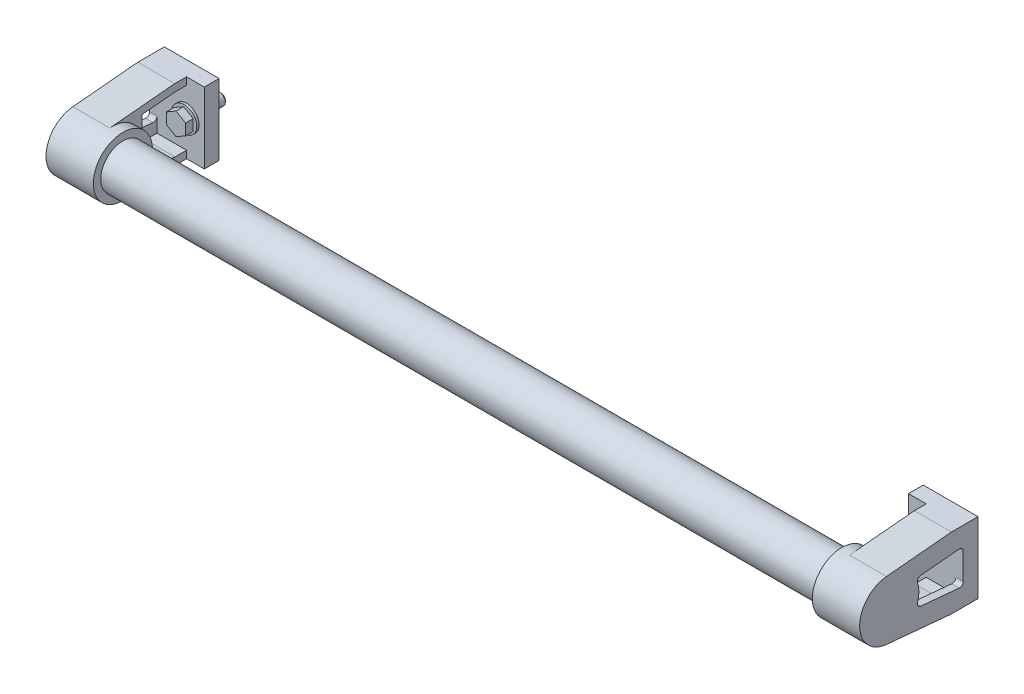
ISO-10303-21;
HEADER;
FILE_DESCRIPTION(('STEP AP214'),'2;1');
FILE_NAME('part.step','',(''),(''),'','','');
FILE_SCHEMA(('AUTOMOTIVE_DESIGN { 1 0 10303 214 1 1 1 1 }'));
ENDSEC;
DATA;
#1=APPLICATION_CONTEXT('core data for automotive mechanical design processes');
#2=APPLICATION_PROTOCOL_DEFINITION('international standard','automotive_design',2000,#1);
#3=PRODUCT_CONTEXT('',#1,'mechanical');
#4=PRODUCT('Part','Part','',(#3));
#5=PRODUCT_RELATED_PRODUCT_CATEGORY('part','',(#4));
#6=PRODUCT_DEFINITION_FORMATION('','',#4);
#7=PRODUCT_DEFINITION_CONTEXT('part definition',#1,'design');
#8=PRODUCT_DEFINITION('design','',#6,#7);
#9=PRODUCT_DEFINITION_SHAPE('','',#8);
#10=(LENGTH_UNIT() NAMED_UNIT(*) SI_UNIT(.MILLI.,.METRE.));
#11=(NAMED_UNIT(*) PLANE_ANGLE_UNIT() SI_UNIT($,.RADIAN.));
#12=(NAMED_UNIT(*) SI_UNIT($,.STERADIAN.) SOLID_ANGLE_UNIT());
#13=UNCERTAINTY_MEASURE_WITH_UNIT(LENGTH_MEASURE(1.E-05),#10,'distance_accuracy_value','');
#14=(GEOMETRIC_REPRESENTATION_CONTEXT(3) GLOBAL_UNCERTAINTY_ASSIGNED_CONTEXT((#13)) GLOBAL_UNIT_ASSIGNED_CONTEXT((#10,
#11,#12)) REPRESENTATION_CONTEXT('',''));
#15=CARTESIAN_POINT('',(0.,0.,0.));
#16=DIRECTION('',(0.,0.,1.));
#17=DIRECTION('',(1.,0.,0.));
#18=AXIS2_PLACEMENT_3D('',#15,#16,#17);
#19=CARTESIAN_POINT('',(16.,-23.9999999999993,18.0000000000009));
#20=DIRECTION('',(0.,0.995687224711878,-0.0927736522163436));
#21=DIRECTION('',(0.,0.0927736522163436,0.995687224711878));
#22=AXIS2_PLACEMENT_3D('',#19,#20,#21);
#23=PLANE('',#22);
#24=DIRECTION('',(0.,0.0927736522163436,0.995687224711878));
#25=VECTOR('',#24,1.);
#26=CARTESIAN_POINT('',(0.,-23.9999999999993,18.0000000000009));
#27=LINE('',#26,#25);
#28=CARTESIAN_POINT('',(0.,-19.9137444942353,61.8554730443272));
#29=VERTEX_POINT('',#28);
#30=CARTESIAN_POINT('',(0.,-23.9999999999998,17.999999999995));
#31=VERTEX_POINT('',#30);
#32=EDGE_CURVE('E1102',#29,#31,#27,.F.);
#33=ORIENTED_EDGE('',*,*,#32,.F.);
#34=DIRECTION('',(-1.,0.,0.));
#35=VECTOR('',#34,1.);
#36=CARTESIAN_POINT('',(7.,-19.9137444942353,61.8554730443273));
#37=LINE('',#36,#35);
#38=CARTESIAN_POINT('',(-25.,-19.9137444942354,61.8554730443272));
#39=VERTEX_POINT('',#38);
#40=EDGE_CURVE('E1038',#39,#29,#37,.F.);
#41=ORIENTED_EDGE('',*,*,#40,.F.);
#42=DIRECTION('',(0.,0.0927736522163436,0.995687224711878));
#43=VECTOR('',#42,1.);
#44=CARTESIAN_POINT('',(-25.,-23.9999999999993,18.0000000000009));
#45=LINE('',#44,#43);
#46=CARTESIAN_POINT('',(-25.,-24.,17.999999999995));
#47=VERTEX_POINT('',#46);
#48=EDGE_CURVE('E1041',#47,#39,#45,.T.);
#49=ORIENTED_EDGE('',*,*,#48,.F.);
#50=DIRECTION('',(1.,0.,0.));
#51=VECTOR('',#50,1.);
#52=CARTESIAN_POINT('',(16.,-24.,17.999999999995));
#53=LINE('',#52,#51);
#54=EDGE_CURVE('E1092',#31,#47,#53,.F.);
#55=ORIENTED_EDGE('',*,*,#54,.F.);
#56=EDGE_LOOP('',(#33,#41,#49,#55));
#57=FACE_BOUND('',#56,.T.);
#58=ADVANCED_FACE('F14',(#57),#23,.F.);
#59=CARTESIAN_POINT('',(16.,24.0000000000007,17.999999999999));
#60=DIRECTION('',(0.,0.995687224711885,0.092773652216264));
#61=DIRECTION('',(0.,-0.092773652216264,0.995687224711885));
#62=AXIS2_PLACEMENT_3D('',#59,#60,#61);
#63=PLANE('',#62);
#64=DIRECTION('',(1.,0.,0.));
#65=VECTOR('',#64,1.);
#66=CARTESIAN_POINT('',(16.,19.9137444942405,61.8554730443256));
#67=LINE('',#66,#65);
#68=CARTESIAN_POINT('',(-25.,19.9137444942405,61.8554730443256));
#69=VERTEX_POINT('',#68);
#70=CARTESIAN_POINT('',(0.,19.9137444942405,61.8554730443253));
#71=VERTEX_POINT('',#70);
#72=EDGE_CURVE('E1033',#69,#71,#67,.T.);
#73=ORIENTED_EDGE('',*,*,#72,.T.);
#74=DIRECTION('',(0.,-0.092773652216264,0.995687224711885));
#75=VECTOR('',#74,1.);
#76=CARTESIAN_POINT('',(0.,24.0000000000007,17.999999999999));
#77=LINE('',#76,#75);
#78=CARTESIAN_POINT('',(0.,24.0000000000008,17.999999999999));
#79=VERTEX_POINT('',#78);
#80=EDGE_CURVE('E1070',#71,#79,#77,.F.);
#81=ORIENTED_EDGE('',*,*,#80,.T.);
#82=DIRECTION('',(1.,0.,0.));
#83=VECTOR('',#82,1.);
#84=CARTESIAN_POINT('',(16.,24.0000000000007,17.999999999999));
#85=LINE('',#84,#83);
#86=CARTESIAN_POINT('',(-25.,24.0000000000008,17.999999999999));
#87=VERTEX_POINT('',#86);
#88=EDGE_CURVE('E1044',#79,#87,#85,.F.);
#89=ORIENTED_EDGE('',*,*,#88,.T.);
#90=DIRECTION('',(0.,-0.092773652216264,0.995687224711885));
#91=VECTOR('',#90,1.);
#92=CARTESIAN_POINT('',(-25.,24.0000000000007,17.999999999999));
#93=LINE('',#92,#91);
#94=EDGE_CURVE('E1037',#87,#69,#93,.T.);
#95=ORIENTED_EDGE('',*,*,#94,.T.);
#96=EDGE_LOOP('',(#73,#81,#89,#95));
#97=FACE_BOUND('',#96,.T.);
#98=ADVANCED_FACE('F931',(#97),#63,.T.);
#99=CARTESIAN_POINT('',(7.,2.62290189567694E-12,60.));
#100=DIRECTION('',(-1.,0.,0.));
#101=DIRECTION('',(0.,0.,1.));
#102=AXIS2_PLACEMENT_3D('',#99,#100,#101);
#103=PLANE('',#102);
#104=CARTESIAN_POINT('',(7.,2.62290189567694E-12,60.));
#105=DIRECTION('',(1.,0.,0.));
#106=DIRECTION('',(0.,0.,-1.));
#107=AXIS2_PLACEMENT_3D('',#104,#105,#106);
#108=CIRCLE('',#107,15.);
#109=CARTESIAN_POINT('',(7.,2.62290189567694E-12,45.));
#110=VERTEX_POINT('',#109);
#111=EDGE_CURVE('E9',#110,#110,#108,.T.);
#112=ORIENTED_EDGE('',*,*,#111,.F.);
#113=EDGE_LOOP('',(#112));
#114=FACE_BOUND('',#113,.T.);
#115=CARTESIAN_POINT('',(7.,2.62290189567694E-12,60.));
#116=DIRECTION('',(-1.,0.,0.));
#117=DIRECTION('',(0.,0.,1.));
#118=AXIS2_PLACEMENT_3D('',#115,#116,#117);
#119=CIRCLE('',#118,20.0000000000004);
#120=CARTESIAN_POINT('',(7.,2.62290189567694E-12,80.0000000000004));
#121=VERTEX_POINT('',#120);
#122=EDGE_CURVE('E1036',#121,#121,#119,.T.);
#123=ORIENTED_EDGE('',*,*,#122,.F.);
#124=EDGE_LOOP('',(#123));
#125=FACE_BOUND('',#124,.T.);
#126=ADVANCED_FACE('F819',(#114,#125),#103,.F.);
#127=CARTESIAN_POINT('',(-6.5,4.9960036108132E-13,12.));
#128=DIRECTION('',(0.,0.,-1.));
#129=DIRECTION('',(0.,1.,0.));
#130=AXIS2_PLACEMENT_3D('',#127,#128,#129);
#131=PLANE('',#130);
#132=CARTESIAN_POINT('',(0.,4.99600361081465E-13,12.));
#133=DIRECTION('',(0.,0.,1.));
#134=DIRECTION('',(0.,-1.,0.));
#135=AXIS2_PLACEMENT_3D('',#132,#133,#134);
#136=CIRCLE('',#135,5.85000000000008);
#137=CARTESIAN_POINT('',(0.,-5.84999999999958,12.0000000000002));
#138=VERTEX_POINT('',#137);
#139=EDGE_CURVE('E992',#138,#138,#136,.F.);
#140=ORIENTED_EDGE('',*,*,#139,.F.);
#141=EDGE_LOOP('',(#140));
#142=FACE_BOUND('',#141,.T.);
#143=DIRECTION('',(0.866025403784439,0.5,0.));
#144=VECTOR('',#143,1.);
#145=CARTESIAN_POINT('',(0.,-7.50555349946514,12.));
#146=LINE('',#145,#144);
#147=CARTESIAN_POINT('',(0.,-7.50555349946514,12.));
#148=VERTEX_POINT('',#147);
#149=CARTESIAN_POINT('',(6.5,-3.75277674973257,12.));
#150=VERTEX_POINT('',#149);
#151=EDGE_CURVE('E985',#148,#150,#146,.T.);
#152=ORIENTED_EDGE('',*,*,#151,.F.);
#153=DIRECTION('',(0.866025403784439,-0.5,0.));
#154=VECTOR('',#153,1.);
#155=CARTESIAN_POINT('',(-6.5,-3.75277674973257,12.));
#156=LINE('',#155,#154);
#157=CARTESIAN_POINT('',(-6.5,-3.75277674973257,12.));
#158=VERTEX_POINT('',#157);
#159=EDGE_CURVE('E1007',#158,#148,#156,.T.);
#160=ORIENTED_EDGE('',*,*,#159,.F.);
#161=DIRECTION('',(0.,-1.,0.));
#162=VECTOR('',#161,1.);
#163=CARTESIAN_POINT('',(-6.5,3.75277674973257,12.));
#164=LINE('',#163,#162);
#165=CARTESIAN_POINT('',(-6.5,3.75277674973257,12.));
#166=VERTEX_POINT('',#165);
#167=EDGE_CURVE('E1000',#166,#158,#164,.T.);
#168=ORIENTED_EDGE('',*,*,#167,.F.);
#169=DIRECTION('',(-0.866025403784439,-0.5,0.));
#170=VECTOR('',#169,1.);
#171=CARTESIAN_POINT('',(0.,7.50555349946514,12.));
#172=LINE('',#171,#170);
#173=CARTESIAN_POINT('',(0.,7.50555349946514,12.));
#174=VERTEX_POINT('',#173);
#175=EDGE_CURVE('E997',#174,#166,#172,.T.);
#176=ORIENTED_EDGE('',*,*,#175,.F.);
#177=DIRECTION('',(-0.866025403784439,0.5,0.));
#178=VECTOR('',#177,1.);
#179=CARTESIAN_POINT('',(6.5,3.75277674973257,12.));
#180=LINE('',#179,#178);
#181=CARTESIAN_POINT('',(6.5,3.75277674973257,12.));
#182=VERTEX_POINT('',#181);
#183=EDGE_CURVE('E990',#182,#174,#180,.T.);
#184=ORIENTED_EDGE('',*,*,#183,.F.);
#185=DIRECTION('',(0.,1.,0.));
#186=VECTOR('',#185,1.);
#187=CARTESIAN_POINT('',(6.5,-3.75277674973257,12.));
#188=LINE('',#187,#186);
#189=EDGE_CURVE('E971',#150,#182,#188,.T.);
#190=ORIENTED_EDGE('',*,*,#189,.F.);
#191=EDGE_LOOP('',(#152,#160,#168,#176,#184,#190));
#192=FACE_BOUND('',#191,.T.);
#193=ADVANCED_FACE('F815',(#142,#192),#131,.T.);
#194=CARTESIAN_POINT('',(0.,3.33066907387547E-12,80.));
#195=DIRECTION('',(0.,0.,1.));
#196=DIRECTION('',(0.,-1.,0.));
#197=AXIS2_PLACEMENT_3D('',#194,#195,#196);
#198=CYLINDRICAL_SURFACE('',#197,5.85000000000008);
#199=ORIENTED_EDGE('',*,*,#139,.T.);
#200=EDGE_LOOP('',(#199));
#201=FACE_BOUND('',#200,.T.);
#202=CARTESIAN_POINT('',(0.,4.82947015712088E-13,11.6));
#203=DIRECTION('',(0.,0.,1.));
#204=DIRECTION('',(0.,-1.,0.));
#205=AXIS2_PLACEMENT_3D('',#202,#203,#204);
#206=CIRCLE('',#205,5.85000000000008);
#207=CARTESIAN_POINT('',(0.,-5.8499999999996,11.6000000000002));
#208=VERTEX_POINT('',#207);
#209=EDGE_CURVE('E1331',#208,#208,#206,.F.);
#210=ORIENTED_EDGE('',*,*,#209,.F.);
#211=EDGE_LOOP('',(#210));
#212=FACE_BOUND('',#211,.T.);
#213=ADVANCED_FACE('F818',(#201,#212),#198,.T.);
#214=CARTESIAN_POINT('',(-5.85,4.71844785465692E-13,11.6));
#215=DIRECTION('',(0.,0.,1.));
#216=DIRECTION('',(0.,-1.,0.));
#217=AXIS2_PLACEMENT_3D('',#214,#215,#216);
#218=PLANE('',#217);
#219=CARTESIAN_POINT('',(0.,4.82947015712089E-13,11.6));
#220=DIRECTION('',(0.,0.,1.));
#221=DIRECTION('',(0.,-1.,0.));
#222=AXIS2_PLACEMENT_3D('',#219,#220,#221);
#223=CIRCLE('',#222,8.50000000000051);
#224=CARTESIAN_POINT('',(0.,-8.50000000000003,11.6000000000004));
#225=VERTEX_POINT('',#224);
#226=EDGE_CURVE('E1278',#225,#225,#223,.F.);
#227=ORIENTED_EDGE('',*,*,#226,.F.);
#228=EDGE_LOOP('',(#227));
#229=FACE_BOUND('',#228,.T.);
#230=ORIENTED_EDGE('',*,*,#209,.T.);
#231=EDGE_LOOP('',(#230));
#232=FACE_BOUND('',#231,.T.);
#233=ADVANCED_FACE('F827',(#229,#232),#218,.T.);
#234=CARTESIAN_POINT('',(0.,5.27355936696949E-13,12.7319341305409));
#235=DIRECTION('',(0.,0.,1.));
#236=DIRECTION('',(0.,-1.,0.));
#237=AXIS2_PLACEMENT_3D('',#234,#235,#236);
#238=CYLINDRICAL_SURFACE('',#237,3.99999999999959);
#239=CARTESIAN_POINT('',(0.,-5.10644337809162E-13,-12.2));
#240=DIRECTION('',(0.,0.,1.));
#241=DIRECTION('',(0.,-1.,0.));
#242=AXIS2_PLACEMENT_3D('',#239,#240,#241);
#243=CIRCLE('',#242,3.99999999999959);
#244=CARTESIAN_POINT('',(0.,-4.0000000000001,-12.1999999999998));
#245=VERTEX_POINT('',#244);
#246=EDGE_CURVE('E1302',#245,#245,#243,.T.);
#247=ORIENTED_EDGE('',*,*,#246,.T.);
#248=EDGE_LOOP('',(#247));
#249=FACE_BOUND('',#248,.T.);
#250=CARTESIAN_POINT('',(0.,0.,0.));
#251=DIRECTION('',(0.,0.,1.));
#252=DIRECTION('',(0.,-1.,0.));
#253=AXIS2_PLACEMENT_3D('',#250,#251,#252);
#254=CIRCLE('',#253,3.99999999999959);
#255=CARTESIAN_POINT('',(0.,-3.99999999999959,1.1102230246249E-13));
#256=VERTEX_POINT('',#255);
#257=EDGE_CURVE('E1173',#256,#256,#254,.T.);
#258=ORIENTED_EDGE('',*,*,#257,.F.);
#259=EDGE_LOOP('',(#258));
#260=FACE_BOUND('',#259,.T.);
#261=ADVANCED_FACE('F831',(#249,#260),#238,.T.);
#262=CARTESIAN_POINT('',(0.,3.33066907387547E-12,80.));
#263=DIRECTION('',(0.,0.,1.));
#264=DIRECTION('',(0.,-1.,0.));
#265=AXIS2_PLACEMENT_3D('',#262,#263,#264);
#266=CYLINDRICAL_SURFACE('',#265,8.50000000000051);
#267=ORIENTED_EDGE('',*,*,#226,.T.);
#268=EDGE_LOOP('',(#267));
#269=FACE_BOUND('',#268,.T.);
#270=CARTESIAN_POINT('',(0.,4.16333634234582E-13,10.));
#271=DIRECTION('',(0.,0.,1.));
#272=DIRECTION('',(0.,-1.,0.));
#273=AXIS2_PLACEMENT_3D('',#270,#271,#272);
#274=CIRCLE('',#273,8.50000000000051);
#275=CARTESIAN_POINT('',(0.,-8.50000000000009,10.0000000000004));
#276=VERTEX_POINT('',#275);
#277=EDGE_CURVE('E1139',#276,#276,#274,.T.);
#278=ORIENTED_EDGE('',*,*,#277,.T.);
#279=EDGE_LOOP('',(#278));
#280=FACE_BOUND('',#279,.T.);
#281=ADVANCED_FACE('F835',(#269,#280),#266,.T.);
#282=CARTESIAN_POINT('',(-20.,-18.9999999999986,40.0000000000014));
#283=DIRECTION('',(1.,0.,0.));
#284=DIRECTION('',(0.,0.,-1.));
#285=AXIS2_PLACEMENT_3D('',#282,#283,#284);
#286=PLANE('',#285);
#287=DIRECTION('',(0.,1.,0.));
#288=VECTOR('',#287,1.);
#289=CARTESIAN_POINT('',(-20.,-23.9999999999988,40.0000000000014));
#290=LINE('',#289,#288);
#291=CARTESIAN_POINT('',(-20.,-16.9284817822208,40.0000000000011));
#292=VERTEX_POINT('',#291);
#293=CARTESIAN_POINT('',(-20.,-8.50076165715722,40.0000000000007));
#294=VERTEX_POINT('',#293);
#295=EDGE_CURVE('E1243',#292,#294,#290,.T.);
#296=ORIENTED_EDGE('',*,*,#295,.F.);
#297=DIRECTION('',(0.,-0.0927736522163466,-0.995687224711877));
#298=VECTOR('',#297,1.);
#299=CARTESIAN_POINT('',(-20.,-18.9999999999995,17.7675646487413));
#300=LINE('',#299,#298);
#301=CARTESIAN_POINT('',(-20.,-18.9999999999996,17.7675646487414));
#302=VERTEX_POINT('',#301);
#303=EDGE_CURVE('E1253',#292,#302,#300,.T.);
#304=ORIENTED_EDGE('',*,*,#303,.T.);
#305=DIRECTION('',(0.,0.,-1.));
#306=VECTOR('',#305,1.);
#307=CARTESIAN_POINT('',(-20.,-19.,10.0000000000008));
#308=LINE('',#307,#306);
#309=CARTESIAN_POINT('',(-20.,-19.,10.0000000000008));
#310=VERTEX_POINT('',#309);
#311=EDGE_CURVE('E1275',#302,#310,#308,.T.);
#312=ORIENTED_EDGE('',*,*,#311,.T.);
#313=DIRECTION('',(0.,1.,0.));
#314=VECTOR('',#313,1.);
#315=CARTESIAN_POINT('',(-20.,-8.94532766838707,10.0000000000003));
#316=LINE('',#315,#314);
#317=CARTESIAN_POINT('',(-20.,-8.94532766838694,10.0000000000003));
#318=VERTEX_POINT('',#317);
#319=EDGE_CURVE('E1133',#310,#318,#316,.T.);
#320=ORIENTED_EDGE('',*,*,#319,.T.);
#321=CARTESIAN_POINT('',(-20.,-8.94532766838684,12.5000000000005));
#322=DIRECTION('',(-1.,0.,0.));
#323=DIRECTION('',(0.,0.,1.));
#324=AXIS2_PLACEMENT_3D('',#321,#322,#323);
#325=CIRCLE('',#324,2.5);
#326=CARTESIAN_POINT('',(-20.,-11.4345457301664,12.7319341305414));
#327=VERTEX_POINT('',#326);
#328=EDGE_CURVE('E1140',#318,#327,#325,.T.);
#329=ORIENTED_EDGE('',*,*,#328,.T.);
#330=DIRECTION('',(0.,0.0927736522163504,0.995687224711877));
#331=VECTOR('',#330,1.);
#332=CARTESIAN_POINT('',(-20.,-11.4345457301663,12.7319341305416));
#333=LINE('',#332,#331);
#334=CARTESIAN_POINT('',(-20.,-9.01504355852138,38.6990847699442));
#335=VERTEX_POINT('',#334);
#336=EDGE_CURVE('E1144',#335,#327,#333,.F.);
#337=ORIENTED_EDGE('',*,*,#336,.F.);
#338=CARTESIAN_POINT('',(-20.,-6.52582549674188,38.4671506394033));
#339=DIRECTION('',(-1.,0.,0.));
#340=DIRECTION('',(0.,0.,1.));
#341=AXIS2_PLACEMENT_3D('',#338,#339,#340);
#342=CIRCLE('',#341,2.5);
#343=EDGE_CURVE('E1149',#335,#294,#342,.T.);
#344=ORIENTED_EDGE('',*,*,#343,.T.);
#345=EDGE_LOOP('',(#296,#304,#312,#320,#329,#337,#344));
#346=FACE_BOUND('',#345,.T.);
#347=ADVANCED_FACE('F839',(#346),#286,.T.);
#348=CARTESIAN_POINT('',(-20.,-18.9999999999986,40.0000000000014));
#349=DIRECTION('',(1.,0.,0.));
#350=DIRECTION('',(0.,0.,-1.));
#351=AXIS2_PLACEMENT_3D('',#348,#349,#350);
#352=PLANE('',#351);
#353=DIRECTION('',(0.,1.,0.));
#354=VECTOR('',#353,1.);
#355=CARTESIAN_POINT('',(-20.,-8.94532766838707,10.0000000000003));
#356=LINE('',#355,#354);
#357=CARTESIAN_POINT('',(-20.,8.94532766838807,9.99999999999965));
#358=VERTEX_POINT('',#357);
#359=CARTESIAN_POINT('',(-20.,19.0000000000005,9.99999999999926));
#360=VERTEX_POINT('',#359);
#361=EDGE_CURVE('E1136',#358,#360,#356,.T.);
#362=ORIENTED_EDGE('',*,*,#361,.T.);
#363=DIRECTION('',(0.,0.,-1.));
#364=VECTOR('',#363,1.);
#365=CARTESIAN_POINT('',(-20.,19.0000000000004,9.99999999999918));
#366=LINE('',#365,#364);
#367=CARTESIAN_POINT('',(-20.,19.0000000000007,17.7675646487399));
#368=VERTEX_POINT('',#367);
#369=EDGE_CURVE('E1211',#368,#360,#366,.T.);
#370=ORIENTED_EDGE('',*,*,#369,.F.);
#371=DIRECTION('',(0.,0.0927736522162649,-0.995687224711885));
#372=VECTOR('',#371,1.);
#373=CARTESIAN_POINT('',(-20.,19.0000000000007,17.7675646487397));
#374=LINE('',#373,#372);
#375=CARTESIAN_POINT('',(-20.,16.9284817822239,40.));
#376=VERTEX_POINT('',#375);
#377=EDGE_CURVE('E1212',#376,#368,#374,.T.);
#378=ORIENTED_EDGE('',*,*,#377,.F.);
#379=DIRECTION('',(0.,1.,0.));
#380=VECTOR('',#379,1.);
#381=CARTESIAN_POINT('',(-20.,-23.9999999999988,40.0000000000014));
#382=LINE('',#381,#380);
#383=CARTESIAN_POINT('',(-20.,8.50076165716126,40.));
#384=VERTEX_POINT('',#383);
#385=EDGE_CURVE('E1222',#384,#376,#382,.T.);
#386=ORIENTED_EDGE('',*,*,#385,.F.);
#387=CARTESIAN_POINT('',(-20.,6.52582549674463,38.4671506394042));
#388=DIRECTION('',(-1.,0.,0.));
#389=DIRECTION('',(0.,0.,1.));
#390=AXIS2_PLACEMENT_3D('',#387,#388,#389);
#391=CIRCLE('',#390,2.5);
#392=CARTESIAN_POINT('',(-20.,9.01504355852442,38.699084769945));
#393=VERTEX_POINT('',#392);
#394=EDGE_CURVE('E1150',#384,#393,#391,.T.);
#395=ORIENTED_EDGE('',*,*,#394,.T.);
#396=DIRECTION('',(0.,-0.0927736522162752,0.995687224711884));
#397=VECTOR('',#396,1.);
#398=CARTESIAN_POINT('',(-20.,11.4345457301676,12.7319341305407));
#399=LINE('',#398,#397);
#400=CARTESIAN_POINT('',(-20.,11.4345457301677,12.7319341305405));
#401=VERTEX_POINT('',#400);
#402=EDGE_CURVE('E1154',#393,#401,#399,.F.);
#403=ORIENTED_EDGE('',*,*,#402,.T.);
#404=CARTESIAN_POINT('',(-20.,8.94532766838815,12.4999999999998));
#405=DIRECTION('',(-1.,0.,0.));
#406=DIRECTION('',(0.,0.,1.));
#407=AXIS2_PLACEMENT_3D('',#404,#405,#406);
#408=CIRCLE('',#407,2.5);
#409=EDGE_CURVE('E1172',#401,#358,#408,.T.);
#410=ORIENTED_EDGE('',*,*,#409,.T.);
#411=EDGE_LOOP('',(#362,#370,#378,#386,#395,#403,#410));
#412=FACE_BOUND('',#411,.T.);
#413=ADVANCED_FACE('F843',(#412),#352,.T.);
#414=CARTESIAN_POINT('',(-11.,-19.,10.0000000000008));
#415=DIRECTION('',(0.,-1.,0.));
#416=DIRECTION('',(0.,0.,-1.));
#417=AXIS2_PLACEMENT_3D('',#414,#415,#416);
#418=PLANE('',#417);
#419=ORIENTED_EDGE('',*,*,#311,.F.);
#420=DIRECTION('',(1.,0.,0.));
#421=VECTOR('',#420,1.);
#422=CARTESIAN_POINT('',(-11.,-18.9999999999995,17.7675646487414));
#423=LINE('',#422,#421);
#424=CARTESIAN_POINT('',(0.,-19.,17.7675646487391));
#425=VERTEX_POINT('',#424);
#426=EDGE_CURVE('E1244',#302,#425,#423,.T.);
#427=ORIENTED_EDGE('',*,*,#426,.T.);
#428=DIRECTION('',(0.,0.,-1.));
#429=VECTOR('',#428,1.);
#430=CARTESIAN_POINT('',(0.,-19.,38.4671506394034));
#431=LINE('',#430,#429);
#432=CARTESIAN_POINT('',(0.,-19.,10.0000000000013));
#433=VERTEX_POINT('',#432);
#434=EDGE_CURVE('E1227',#433,#425,#431,.F.);
#435=ORIENTED_EDGE('',*,*,#434,.F.);
#436=DIRECTION('',(1.,0.,0.));
#437=VECTOR('',#436,1.);
#438=CARTESIAN_POINT('',(16.,-19.,10.0000000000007));
#439=LINE('',#438,#437);
#440=EDGE_CURVE('E1187',#433,#310,#439,.F.);
#441=ORIENTED_EDGE('',*,*,#440,.T.);
#442=EDGE_LOOP('',(#419,#427,#435,#441));
#443=FACE_BOUND('',#442,.T.);
#444=ADVANCED_FACE('F847',(#443),#418,.F.);
#445=CARTESIAN_POINT('',(-11.,-18.9999999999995,17.7675646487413));
#446=DIRECTION('',(0.,-0.995687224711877,0.0927736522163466));
#447=DIRECTION('',(0.,-0.0927736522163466,-0.995687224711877));
#448=AXIS2_PLACEMENT_3D('',#445,#446,#447);
#449=PLANE('',#448);
#450=ORIENTED_EDGE('',*,*,#303,.F.);
#451=DIRECTION('',(1.,0.,0.));
#452=VECTOR('',#451,1.);
#453=CARTESIAN_POINT('',(3.99999999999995,-16.9284817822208,40.0000000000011));
#454=LINE('',#453,#452);
#455=CARTESIAN_POINT('',(0.,-16.9284817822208,40.0000000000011));
#456=VERTEX_POINT('',#455);
#457=EDGE_CURVE('E1240',#456,#292,#454,.F.);
#458=ORIENTED_EDGE('',*,*,#457,.F.);
#459=DIRECTION('',(0.,0.0927736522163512,0.995687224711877));
#460=VECTOR('',#459,1.);
#461=CARTESIAN_POINT('',(0.,-18.9999999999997,17.7675646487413));
#462=LINE('',#461,#460);
#463=EDGE_CURVE('E1120',#425,#456,#462,.T.);
#464=ORIENTED_EDGE('',*,*,#463,.F.);
#465=ORIENTED_EDGE('',*,*,#426,.F.);
#466=EDGE_LOOP('',(#450,#458,#464,#465));
#467=FACE_BOUND('',#466,.T.);
#468=ADVANCED_FACE('F851',(#467),#449,.F.);
#469=CARTESIAN_POINT('',(3.99999999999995,-23.9999999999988,40.0000000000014));
#470=DIRECTION('',(0.,0.,-1.));
#471=DIRECTION('',(0.,1.,0.));
#472=AXIS2_PLACEMENT_3D('',#469,#470,#471);
#473=PLANE('',#472);
#474=ORIENTED_EDGE('',*,*,#457,.T.);
#475=ORIENTED_EDGE('',*,*,#295,.T.);
#476=DIRECTION('',(-1.,0.,0.));
#477=VECTOR('',#476,1.);
#478=CARTESIAN_POINT('',(16.,-8.50076165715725,40.0000000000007));
#479=LINE('',#478,#477);
#480=CARTESIAN_POINT('',(0.,-8.50076165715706,40.0000000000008));
#481=VERTEX_POINT('',#480);
#482=EDGE_CURVE('E1145',#294,#481,#479,.F.);
#483=ORIENTED_EDGE('',*,*,#482,.T.);
#484=DIRECTION('',(0.,1.,0.));
#485=VECTOR('',#484,1.);
#486=CARTESIAN_POINT('',(0.,-6.52582549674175,40.0000000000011));
#487=LINE('',#486,#485);
#488=EDGE_CURVE('E1116',#456,#481,#487,.T.);
#489=ORIENTED_EDGE('',*,*,#488,.F.);
#490=EDGE_LOOP('',(#474,#475,#483,#489));
#491=FACE_BOUND('',#490,.T.);
#492=ADVANCED_FACE('F855',(#491),#473,.T.);
#493=CARTESIAN_POINT('',(3.99999999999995,-23.9999999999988,40.0000000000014));
#494=DIRECTION('',(0.,0.,-1.));
#495=DIRECTION('',(0.,1.,0.));
#496=AXIS2_PLACEMENT_3D('',#493,#494,#495);
#497=PLANE('',#496);
#498=DIRECTION('',(-1.,0.,0.));
#499=VECTOR('',#498,1.);
#500=CARTESIAN_POINT('',(16.,8.50076165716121,40.));
#501=LINE('',#500,#499);
#502=CARTESIAN_POINT('',(0.,8.50076165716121,40.));
#503=VERTEX_POINT('',#502);
#504=EDGE_CURVE('E1153',#503,#384,#501,.T.);
#505=ORIENTED_EDGE('',*,*,#504,.T.);
#506=ORIENTED_EDGE('',*,*,#385,.T.);
#507=DIRECTION('',(1.,0.,0.));
#508=VECTOR('',#507,1.);
#509=CARTESIAN_POINT('',(-11.,16.9284817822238,40.));
#510=LINE('',#509,#508);
#511=CARTESIAN_POINT('',(0.,16.9284817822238,40.));
#512=VERTEX_POINT('',#511);
#513=EDGE_CURVE('E1219',#512,#376,#510,.F.);
#514=ORIENTED_EDGE('',*,*,#513,.F.);
#515=DIRECTION('',(0.,1.,0.));
#516=VECTOR('',#515,1.);
#517=CARTESIAN_POINT('',(0.,2.62290189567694E-12,40.));
#518=LINE('',#517,#516);
#519=EDGE_CURVE('E1084',#503,#512,#518,.T.);
#520=ORIENTED_EDGE('',*,*,#519,.F.);
#521=EDGE_LOOP('',(#505,#506,#514,#520));
#522=FACE_BOUND('',#521,.T.);
#523=ADVANCED_FACE('F859',(#522),#497,.T.);
#524=CARTESIAN_POINT('',(-11.,19.0000000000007,17.7675646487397));
#525=DIRECTION('',(0.,-0.995687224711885,-0.0927736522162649));
#526=DIRECTION('',(0.,0.0927736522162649,-0.995687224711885));
#527=AXIS2_PLACEMENT_3D('',#524,#525,#526);
#528=PLANE('',#527);
#529=DIRECTION('',(1.,0.,0.));
#530=VECTOR('',#529,1.);
#531=CARTESIAN_POINT('',(-11.,19.0000000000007,17.7675646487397));
#532=LINE('',#531,#530);
#533=CARTESIAN_POINT('',(0.,19.0000000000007,17.7675646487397));
#534=VERTEX_POINT('',#533);
#535=EDGE_CURVE('E1208',#534,#368,#532,.F.);
#536=ORIENTED_EDGE('',*,*,#535,.F.);
#537=DIRECTION('',(0.,0.0927736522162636,-0.995687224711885));
#538=VECTOR('',#537,1.);
#539=CARTESIAN_POINT('',(0.,16.9284817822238,40.));
#540=LINE('',#539,#538);
#541=EDGE_CURVE('E1087',#512,#534,#540,.T.);
#542=ORIENTED_EDGE('',*,*,#541,.F.);
#543=ORIENTED_EDGE('',*,*,#513,.T.);
#544=ORIENTED_EDGE('',*,*,#377,.T.);
#545=EDGE_LOOP('',(#536,#542,#543,#544));
#546=FACE_BOUND('',#545,.T.);
#547=ADVANCED_FACE('F863',(#546),#528,.T.);
#548=CARTESIAN_POINT('',(-11.,19.0000000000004,9.99999999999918));
#549=DIRECTION('',(0.,-1.,0.));
#550=DIRECTION('',(0.,0.,-1.));
#551=AXIS2_PLACEMENT_3D('',#548,#549,#550);
#552=PLANE('',#551);
#553=DIRECTION('',(1.,0.,0.));
#554=VECTOR('',#553,1.);
#555=CARTESIAN_POINT('',(16.,19.0000000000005,9.99999999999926));
#556=LINE('',#555,#554);
#557=CARTESIAN_POINT('',(0.,19.0000000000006,9.99999999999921));
#558=VERTEX_POINT('',#557);
#559=EDGE_CURVE('E1198',#360,#558,#556,.T.);
#560=ORIENTED_EDGE('',*,*,#559,.T.);
#561=DIRECTION('',(0.,0.,-1.));
#562=VECTOR('',#561,1.);
#563=CARTESIAN_POINT('',(0.,19.0000000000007,60.));
#564=LINE('',#563,#562);
#565=EDGE_CURVE('E1193',#534,#558,#564,.T.);
#566=ORIENTED_EDGE('',*,*,#565,.F.);
#567=ORIENTED_EDGE('',*,*,#535,.T.);
#568=ORIENTED_EDGE('',*,*,#369,.T.);
#569=EDGE_LOOP('',(#560,#566,#567,#568));
#570=FACE_BOUND('',#569,.T.);
#571=ADVANCED_FACE('F867',(#570),#552,.T.);
#572=CARTESIAN_POINT('',(12.,-24.,10.0000000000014));
#573=DIRECTION('',(1.,0.,0.));
#574=DIRECTION('',(0.,0.,-1.));
#575=AXIS2_PLACEMENT_3D('',#572,#573,#574);
#576=PLANE('',#575);
#577=DIRECTION('',(0.,1.,0.));
#578=VECTOR('',#577,1.);
#579=CARTESIAN_POINT('',(12.,-24.0000000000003,9.43689570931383E-13));
#580=LINE('',#579,#578);
#581=CARTESIAN_POINT('',(12.,24.,-1.0177044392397E-12));
#582=VERTEX_POINT('',#581);
#583=CARTESIAN_POINT('',(12.,-24.0000000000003,9.43689570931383E-13));
#584=VERTEX_POINT('',#583);
#585=EDGE_CURVE('E1169',#582,#584,#580,.F.);
#586=ORIENTED_EDGE('',*,*,#585,.F.);
#587=DIRECTION('',(0.,0.,1.));
#588=VECTOR('',#587,1.);
#589=CARTESIAN_POINT('',(12.,24.,-1.0547118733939E-12));
#590=LINE('',#589,#588);
#591=CARTESIAN_POINT('',(12.,24.0000000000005,9.99999999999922));
#592=VERTEX_POINT('',#591);
#593=EDGE_CURVE('E1157',#592,#582,#590,.F.);
#594=ORIENTED_EDGE('',*,*,#593,.F.);
#595=DIRECTION('',(0.,1.,0.));
#596=VECTOR('',#595,1.);
#597=CARTESIAN_POINT('',(12.,-8.94532766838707,10.0000000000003));
#598=LINE('',#597,#596);
#599=CARTESIAN_POINT('',(12.,-24.,10.0000000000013));
#600=VERTEX_POINT('',#599);
#601=EDGE_CURVE('E1184',#592,#600,#598,.F.);
#602=ORIENTED_EDGE('',*,*,#601,.T.);
#603=DIRECTION('',(0.,0.,1.));
#604=VECTOR('',#603,1.);
#605=CARTESIAN_POINT('',(12.,-24.0000000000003,9.43689570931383E-13));
#606=LINE('',#605,#604);
#607=EDGE_CURVE('E1166',#600,#584,#606,.F.);
#608=ORIENTED_EDGE('',*,*,#607,.T.);
#609=EDGE_LOOP('',(#586,#594,#602,#608));
#610=FACE_BOUND('',#609,.T.);
#611=ADVANCED_FACE('F871',(#610),#576,.T.);
#612=CARTESIAN_POINT('',(16.,-24.0000000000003,9.43689570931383E-13));
#613=DIRECTION('',(0.,0.,-1.));
#614=DIRECTION('',(0.,1.,0.));
#615=AXIS2_PLACEMENT_3D('',#612,#613,#614);
#616=PLANE('',#615);
#617=DIRECTION('',(1.,0.,0.));
#618=VECTOR('',#617,1.);
#619=CARTESIAN_POINT('',(16.,-24.0000000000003,9.43689570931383E-13));
#620=LINE('',#619,#618);
#621=CARTESIAN_POINT('',(-25.,-24.0000000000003,-3.88578058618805E-13));
#622=VERTEX_POINT('',#621);
#623=EDGE_CURVE('E1108',#584,#622,#620,.F.);
#624=ORIENTED_EDGE('',*,*,#623,.T.);
#625=DIRECTION('',(0.,1.,0.));
#626=VECTOR('',#625,1.);
#627=CARTESIAN_POINT('',(-25.,2.62290189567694E-12,-1.0547118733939E-12));
#628=LINE('',#627,#626);
#629=CARTESIAN_POINT('',(-25.,24.0000000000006,-1.0547118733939E-12));
#630=VERTEX_POINT('',#629);
#631=EDGE_CURVE('E1064',#630,#622,#628,.F.);
#632=ORIENTED_EDGE('',*,*,#631,.F.);
#633=DIRECTION('',(1.,0.,0.));
#634=VECTOR('',#633,1.);
#635=CARTESIAN_POINT('',(16.,24.,-1.0547118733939E-12));
#636=LINE('',#635,#634);
#637=EDGE_CURVE('E1097',#582,#630,#636,.F.);
#638=ORIENTED_EDGE('',*,*,#637,.F.);
#639=ORIENTED_EDGE('',*,*,#585,.T.);
#640=EDGE_LOOP('',(#624,#632,#638,#639));
#641=FACE_BOUND('',#640,.T.);
#642=ORIENTED_EDGE('',*,*,#257,.T.);
#643=EDGE_LOOP('',(#642));
#644=FACE_BOUND('',#643,.T.);
#645=ADVANCED_FACE('F875',(#641,#644),#616,.T.);
#646=CARTESIAN_POINT('',(7.,8.94532766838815,12.4999999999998));
#647=DIRECTION('',(-1.,0.,0.));
#648=DIRECTION('',(0.,0.,1.));
#649=AXIS2_PLACEMENT_3D('',#646,#647,#648);
#650=CYLINDRICAL_SURFACE('',#649,2.5);
#651=DIRECTION('',(1.,0.,0.));
#652=VECTOR('',#651,1.);
#653=CARTESIAN_POINT('',(7.,11.4345457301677,12.7319341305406));
#654=LINE('',#653,#652);
#655=CARTESIAN_POINT('',(-25.,11.4345457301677,12.7319341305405));
#656=VERTEX_POINT('',#655);
#657=EDGE_CURVE('E1151',#401,#656,#654,.F.);
#658=ORIENTED_EDGE('',*,*,#657,.T.);
#659=CARTESIAN_POINT('',(-25.,8.94532766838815,12.4999999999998));
#660=DIRECTION('',(-1.,0.,0.));
#661=DIRECTION('',(0.,0.,1.));
#662=AXIS2_PLACEMENT_3D('',#659,#660,#661);
#663=CIRCLE('',#662,2.5);
#664=CARTESIAN_POINT('',(-25.,8.94532766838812,10.));
#665=VERTEX_POINT('',#664);
#666=EDGE_CURVE('E1060',#665,#656,#663,.F.);
#667=ORIENTED_EDGE('',*,*,#666,.F.);
#668=DIRECTION('',(1.,0.,0.));
#669=VECTOR('',#668,1.);
#670=CARTESIAN_POINT('',(16.,8.94532766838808,9.99999999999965));
#671=LINE('',#670,#669);
#672=EDGE_CURVE('E1132',#665,#358,#671,.T.);
#673=ORIENTED_EDGE('',*,*,#672,.T.);
#674=ORIENTED_EDGE('',*,*,#409,.F.);
#675=EDGE_LOOP('',(#658,#667,#673,#674));
#676=FACE_BOUND('',#675,.T.);
#677=ADVANCED_FACE('F879',(#676),#650,.F.);
#678=CARTESIAN_POINT('',(7.,11.4345457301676,12.7319341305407));
#679=DIRECTION('',(0.,0.995687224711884,0.0927736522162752));
#680=DIRECTION('',(0.,-0.0927736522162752,0.995687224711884));
#681=AXIS2_PLACEMENT_3D('',#678,#679,#680);
#682=PLANE('',#681);
#683=DIRECTION('',(0.,-0.0927736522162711,0.995687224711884));
#684=VECTOR('',#683,1.);
#685=CARTESIAN_POINT('',(-25.,11.4345457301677,12.7319341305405));
#686=LINE('',#685,#684);
#687=CARTESIAN_POINT('',(-25.,9.01504355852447,38.699084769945));
#688=VERTEX_POINT('',#687);
#689=EDGE_CURVE('E1056',#656,#688,#686,.T.);
#690=ORIENTED_EDGE('',*,*,#689,.F.);
#691=ORIENTED_EDGE('',*,*,#657,.F.);
#692=ORIENTED_EDGE('',*,*,#402,.F.);
#693=DIRECTION('',(-1.,0.,0.));
#694=VECTOR('',#693,1.);
#695=CARTESIAN_POINT('',(16.,9.01504355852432,38.6990847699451));
#696=LINE('',#695,#694);
#697=EDGE_CURVE('E1146',#393,#688,#696,.T.);
#698=ORIENTED_EDGE('',*,*,#697,.T.);
#699=EDGE_LOOP('',(#690,#691,#692,#698));
#700=FACE_BOUND('',#699,.T.);
#701=ADVANCED_FACE('F883',(#700),#682,.F.);
#702=CARTESIAN_POINT('',(7.,-11.4345457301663,12.7319341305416));
#703=DIRECTION('',(0.,0.995687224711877,-0.0927736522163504));
#704=DIRECTION('',(0.,0.0927736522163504,0.995687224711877));
#705=AXIS2_PLACEMENT_3D('',#702,#703,#704);
#706=PLANE('',#705);
#707=DIRECTION('',(-1.,0.,0.));
#708=VECTOR('',#707,1.);
#709=CARTESIAN_POINT('',(7.,-11.4345457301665,12.7319341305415));
#710=LINE('',#709,#708);
#711=CARTESIAN_POINT('',(-25.,-11.4345457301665,12.7319341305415));
#712=VERTEX_POINT('',#711);
#713=EDGE_CURVE('E1137',#327,#712,#710,.T.);
#714=ORIENTED_EDGE('',*,*,#713,.T.);
#715=DIRECTION('',(0.,-0.0927736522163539,-0.995687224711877));
#716=VECTOR('',#715,1.);
#717=CARTESIAN_POINT('',(-25.,-9.01504355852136,38.6990847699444));
#718=LINE('',#717,#716);
#719=CARTESIAN_POINT('',(-25.,-9.01504355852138,38.6990847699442));
#720=VERTEX_POINT('',#719);
#721=EDGE_CURVE('E1052',#720,#712,#718,.T.);
#722=ORIENTED_EDGE('',*,*,#721,.F.);
#723=DIRECTION('',(1.,0.,0.));
#724=VECTOR('',#723,1.);
#725=CARTESIAN_POINT('',(7.,-9.01504355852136,38.6990847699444));
#726=LINE('',#725,#724);
#727=EDGE_CURVE('E1141',#720,#335,#726,.T.);
#728=ORIENTED_EDGE('',*,*,#727,.T.);
#729=ORIENTED_EDGE('',*,*,#336,.T.);
#730=EDGE_LOOP('',(#714,#722,#728,#729));
#731=FACE_BOUND('',#730,.T.);
#732=ADVANCED_FACE('F887',(#731),#706,.T.);
#733=CARTESIAN_POINT('',(7.,-8.94532766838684,12.5000000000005));
#734=DIRECTION('',(-1.,0.,0.));
#735=DIRECTION('',(0.,0.,1.));
#736=AXIS2_PLACEMENT_3D('',#733,#734,#735);
#737=CYLINDRICAL_SURFACE('',#736,2.5);
#738=CARTESIAN_POINT('',(-25.,-8.94532766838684,12.5000000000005));
#739=DIRECTION('',(-1.,0.,0.));
#740=DIRECTION('',(0.,0.,1.));
#741=AXIS2_PLACEMENT_3D('',#738,#739,#740);
#742=CIRCLE('',#741,2.5);
#743=CARTESIAN_POINT('',(-25.,-8.94532766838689,10.0000000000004));
#744=VERTEX_POINT('',#743);
#745=EDGE_CURVE('E1051',#712,#744,#742,.F.);
#746=ORIENTED_EDGE('',*,*,#745,.F.);
#747=ORIENTED_EDGE('',*,*,#713,.F.);
#748=ORIENTED_EDGE('',*,*,#328,.F.);
#749=DIRECTION('',(1.,0.,0.));
#750=VECTOR('',#749,1.);
#751=CARTESIAN_POINT('',(16.,-8.94532766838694,10.0000000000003));
#752=LINE('',#751,#750);
#753=EDGE_CURVE('E1130',#318,#744,#752,.F.);
#754=ORIENTED_EDGE('',*,*,#753,.T.);
#755=EDGE_LOOP('',(#746,#747,#748,#754));
#756=FACE_BOUND('',#755,.T.);
#757=ADVANCED_FACE('F891',(#756),#737,.F.);
#758=CARTESIAN_POINT('',(16.,-8.94532766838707,10.0000000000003));
#759=DIRECTION('',(0.,0.,-1.));
#760=DIRECTION('',(0.,1.,0.));
#761=AXIS2_PLACEMENT_3D('',#758,#759,#760);
#762=PLANE('',#761);
#763=ORIENTED_EDGE('',*,*,#559,.F.);
#764=ORIENTED_EDGE('',*,*,#361,.F.);
#765=ORIENTED_EDGE('',*,*,#672,.F.);
#766=DIRECTION('',(0.,1.,0.));
#767=VECTOR('',#766,1.);
#768=CARTESIAN_POINT('',(-25.,2.62290189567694E-12,10.0000000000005));
#769=LINE('',#768,#767);
#770=EDGE_CURVE('E1047',#744,#665,#769,.T.);
#771=ORIENTED_EDGE('',*,*,#770,.F.);
#772=ORIENTED_EDGE('',*,*,#753,.F.);
#773=ORIENTED_EDGE('',*,*,#319,.F.);
#774=ORIENTED_EDGE('',*,*,#440,.F.);
#775=DIRECTION('',(0.,1.,0.));
#776=VECTOR('',#775,1.);
#777=CARTESIAN_POINT('',(0.,-6.52582549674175,10.0000000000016));
#778=LINE('',#777,#776);
#779=CARTESIAN_POINT('',(0.,-24.,10.0000000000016));
#780=VERTEX_POINT('',#779);
#781=EDGE_CURVE('E1201',#780,#433,#778,.T.);
#782=ORIENTED_EDGE('',*,*,#781,.F.);
#783=DIRECTION('',(1.,0.,0.));
#784=VECTOR('',#783,1.);
#785=CARTESIAN_POINT('',(16.,-24.,10.0000000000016));
#786=LINE('',#785,#784);
#787=EDGE_CURVE('E1088',#780,#600,#786,.T.);
#788=ORIENTED_EDGE('',*,*,#787,.T.);
#789=ORIENTED_EDGE('',*,*,#601,.F.);
#790=DIRECTION('',(1.,0.,0.));
#791=VECTOR('',#790,1.);
#792=CARTESIAN_POINT('',(16.,24.0000000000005,9.9999999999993));
#793=LINE('',#792,#791);
#794=CARTESIAN_POINT('',(0.,24.0000000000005,9.99999999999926));
#795=VERTEX_POINT('',#794);
#796=EDGE_CURVE('E1076',#795,#592,#793,.T.);
#797=ORIENTED_EDGE('',*,*,#796,.F.);
#798=DIRECTION('',(0.,1.,0.));
#799=VECTOR('',#798,1.);
#800=CARTESIAN_POINT('',(0.,2.62290189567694E-12,9.99999999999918));
#801=LINE('',#800,#799);
#802=EDGE_CURVE('E1190',#558,#795,#801,.T.);
#803=ORIENTED_EDGE('',*,*,#802,.F.);
#804=EDGE_LOOP('',(#763,#764,#765,#771,#772,#773,#774,#782,#788,#789,#797,#803));
#805=FACE_BOUND('',#804,.T.);
#806=ORIENTED_EDGE('',*,*,#277,.F.);
#807=EDGE_LOOP('',(#806));
#808=FACE_BOUND('',#807,.T.);
#809=ADVANCED_FACE('F895',(#805,#808),#762,.F.);
#810=CARTESIAN_POINT('',(16.,6.52582549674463,38.4671506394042));
#811=DIRECTION('',(-1.,0.,0.));
#812=DIRECTION('',(0.,0.,1.));
#813=AXIS2_PLACEMENT_3D('',#810,#811,#812);
#814=CYLINDRICAL_SURFACE('',#813,2.5);
#815=CARTESIAN_POINT('',(0.,6.52582549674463,38.4671506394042));
#816=DIRECTION('',(-1.,0.,0.));
#817=DIRECTION('',(0.,0.,1.));
#818=AXIS2_PLACEMENT_3D('',#815,#816,#817);
#819=CIRCLE('',#818,2.5);
#820=CARTESIAN_POINT('',(0.,5.80073377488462,40.8596894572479));
#821=VERTEX_POINT('',#820);
#822=EDGE_CURVE('E1077',#821,#503,#819,.T.);
#823=ORIENTED_EDGE('',*,*,#822,.F.);
#824=DIRECTION('',(-1.,0.,0.));
#825=VECTOR('',#824,1.);
#826=CARTESIAN_POINT('',(7.,5.8007337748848,40.8596894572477));
#827=LINE('',#826,#825);
#828=CARTESIAN_POINT('',(-25.,5.80073377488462,40.8596894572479));
#829=VERTEX_POINT('',#828);
#830=EDGE_CURVE('E1050',#829,#821,#827,.F.);
#831=ORIENTED_EDGE('',*,*,#830,.F.);
#832=CARTESIAN_POINT('',(-25.,6.52582549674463,38.4671506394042));
#833=DIRECTION('',(-1.,0.,0.));
#834=DIRECTION('',(0.,0.,1.));
#835=AXIS2_PLACEMENT_3D('',#832,#833,#834);
#836=CIRCLE('',#835,2.5);
#837=EDGE_CURVE('E1059',#688,#829,#836,.F.);
#838=ORIENTED_EDGE('',*,*,#837,.F.);
#839=ORIENTED_EDGE('',*,*,#697,.F.);
#840=ORIENTED_EDGE('',*,*,#394,.F.);
#841=ORIENTED_EDGE('',*,*,#504,.F.);
#842=EDGE_LOOP('',(#823,#831,#838,#839,#840,#841));
#843=FACE_BOUND('',#842,.T.);
#844=ADVANCED_FACE('F899',(#843),#814,.F.);
#845=CARTESIAN_POINT('',(16.,-6.52582549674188,38.4671506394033));
#846=DIRECTION('',(-1.,0.,0.));
#847=DIRECTION('',(0.,0.,1.));
#848=AXIS2_PLACEMENT_3D('',#845,#846,#847);
#849=CYLINDRICAL_SURFACE('',#848,2.5);
#850=CARTESIAN_POINT('',(0.,-6.52582549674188,38.4671506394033));
#851=DIRECTION('',(-1.,0.,0.));
#852=DIRECTION('',(0.,0.,1.));
#853=AXIS2_PLACEMENT_3D('',#850,#851,#852);
#854=CIRCLE('',#853,2.5);
#855=CARTESIAN_POINT('',(0.,-5.80073377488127,40.8596894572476));
#856=VERTEX_POINT('',#855);
#857=EDGE_CURVE('E1119',#481,#856,#854,.T.);
#858=ORIENTED_EDGE('',*,*,#857,.F.);
#859=ORIENTED_EDGE('',*,*,#482,.F.);
#860=ORIENTED_EDGE('',*,*,#343,.F.);
#861=ORIENTED_EDGE('',*,*,#727,.F.);
#862=CARTESIAN_POINT('',(-25.,-6.52582549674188,38.4671506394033));
#863=DIRECTION('',(-1.,0.,0.));
#864=DIRECTION('',(0.,0.,1.));
#865=AXIS2_PLACEMENT_3D('',#862,#863,#864);
#866=CIRCLE('',#865,2.5);
#867=CARTESIAN_POINT('',(-25.,-5.80073377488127,40.8596894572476));
#868=VERTEX_POINT('',#867);
#869=EDGE_CURVE('E1055',#868,#720,#866,.F.);
#870=ORIENTED_EDGE('',*,*,#869,.F.);
#871=DIRECTION('',(-1.,0.,0.));
#872=VECTOR('',#871,1.);
#873=CARTESIAN_POINT('',(7.,-5.80073377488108,40.8596894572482));
#874=LINE('',#873,#872);
#875=EDGE_CURVE('E1123',#856,#868,#874,.T.);
#876=ORIENTED_EDGE('',*,*,#875,.F.);
#877=EDGE_LOOP('',(#858,#859,#860,#861,#870,#876));
#878=FACE_BOUND('',#877,.T.);
#879=ADVANCED_FACE('F903',(#878),#849,.F.);
#880=CARTESIAN_POINT('',(0.,-6.52582549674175,38.4671506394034));
#881=DIRECTION('',(1.,0.,0.));
#882=DIRECTION('',(0.,0.,-1.));
#883=AXIS2_PLACEMENT_3D('',#880,#881,#882);
#884=PLANE('',#883);
#885=ORIENTED_EDGE('',*,*,#488,.T.);
#886=ORIENTED_EDGE('',*,*,#857,.T.);
#887=CARTESIAN_POINT('',(0.,2.62290189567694E-12,60.));
#888=DIRECTION('',(-1.,0.,0.));
#889=DIRECTION('',(0.,0.,1.));
#890=AXIS2_PLACEMENT_3D('',#887,#888,#889);
#891=CIRCLE('',#890,20.0000000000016);
#892=EDGE_CURVE('E1126',#29,#856,#891,.F.);
#893=ORIENTED_EDGE('',*,*,#892,.F.);
#894=ORIENTED_EDGE('',*,*,#32,.T.);
#895=DIRECTION('',(0.,0.,1.));
#896=VECTOR('',#895,1.);
#897=CARTESIAN_POINT('',(0.,-24.0000000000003,9.43689570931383E-13));
#898=LINE('',#897,#896);
#899=EDGE_CURVE('E1105',#31,#780,#898,.F.);
#900=ORIENTED_EDGE('',*,*,#899,.T.);
#901=ORIENTED_EDGE('',*,*,#781,.T.);
#902=ORIENTED_EDGE('',*,*,#434,.T.);
#903=ORIENTED_EDGE('',*,*,#463,.T.);
#904=EDGE_LOOP('',(#885,#886,#893,#894,#900,#901,#902,#903));
#905=FACE_BOUND('',#904,.T.);
#906=ADVANCED_FACE('F907',(#905),#884,.T.);
#907=CARTESIAN_POINT('',(16.,-24.0000000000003,9.43689570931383E-13));
#908=DIRECTION('',(0.,1.,0.));
#909=DIRECTION('',(0.,0.,1.));
#910=AXIS2_PLACEMENT_3D('',#907,#908,#909);
#911=PLANE('',#910);
#912=ORIENTED_EDGE('',*,*,#899,.F.);
#913=ORIENTED_EDGE('',*,*,#54,.T.);
#914=DIRECTION('',(0.,0.,1.));
#915=VECTOR('',#914,1.);
#916=CARTESIAN_POINT('',(-25.,-24.0000000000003,60.));
#917=LINE('',#916,#915);
#918=EDGE_CURVE('E1065',#622,#47,#917,.T.);
#919=ORIENTED_EDGE('',*,*,#918,.F.);
#920=ORIENTED_EDGE('',*,*,#623,.F.);
#921=ORIENTED_EDGE('',*,*,#607,.F.);
#922=ORIENTED_EDGE('',*,*,#787,.F.);
#923=EDGE_LOOP('',(#912,#913,#919,#920,#921,#922));
#924=FACE_BOUND('',#923,.T.);
#925=ADVANCED_FACE('F911',(#924),#911,.F.);
#926=CARTESIAN_POINT('',(0.,2.62290189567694E-12,60.));
#927=DIRECTION('',(1.,0.,0.));
#928=DIRECTION('',(0.,0.,-1.));
#929=AXIS2_PLACEMENT_3D('',#926,#927,#928);
#930=PLANE('',#929);
#931=DIRECTION('',(0.,0.,1.));
#932=VECTOR('',#931,1.);
#933=CARTESIAN_POINT('',(0.,24.,-1.0547118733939E-12));
#934=LINE('',#933,#932);
#935=EDGE_CURVE('E1073',#79,#795,#934,.F.);
#936=ORIENTED_EDGE('',*,*,#935,.F.);
#937=ORIENTED_EDGE('',*,*,#80,.F.);
#938=CARTESIAN_POINT('',(0.,2.62290189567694E-12,60.));
#939=DIRECTION('',(-1.,0.,0.));
#940=DIRECTION('',(0.,0.,1.));
#941=AXIS2_PLACEMENT_3D('',#938,#939,#940);
#942=CIRCLE('',#941,20.0000000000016);
#943=EDGE_CURVE('E1129',#821,#71,#942,.F.);
#944=ORIENTED_EDGE('',*,*,#943,.F.);
#945=ORIENTED_EDGE('',*,*,#822,.T.);
#946=ORIENTED_EDGE('',*,*,#519,.T.);
#947=ORIENTED_EDGE('',*,*,#541,.T.);
#948=ORIENTED_EDGE('',*,*,#565,.T.);
#949=ORIENTED_EDGE('',*,*,#802,.T.);
#950=EDGE_LOOP('',(#936,#937,#944,#945,#946,#947,#948,#949));
#951=FACE_BOUND('',#950,.T.);
#952=ADVANCED_FACE('F915',(#951),#930,.T.);
#953=CARTESIAN_POINT('',(16.,24.,-1.0547118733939E-12));
#954=DIRECTION('',(0.,1.,0.));
#955=DIRECTION('',(0.,0.,1.));
#956=AXIS2_PLACEMENT_3D('',#953,#954,#955);
#957=PLANE('',#956);
#958=DIRECTION('',(0.,0.,1.));
#959=VECTOR('',#958,1.);
#960=CARTESIAN_POINT('',(-25.,24.0000000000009,60.));
#961=LINE('',#960,#959);
#962=EDGE_CURVE('E1061',#87,#630,#961,.F.);
#963=ORIENTED_EDGE('',*,*,#962,.F.);
#964=ORIENTED_EDGE('',*,*,#88,.F.);
#965=ORIENTED_EDGE('',*,*,#935,.T.);
#966=ORIENTED_EDGE('',*,*,#796,.T.);
#967=ORIENTED_EDGE('',*,*,#593,.T.);
#968=ORIENTED_EDGE('',*,*,#637,.T.);
#969=EDGE_LOOP('',(#963,#964,#965,#966,#967,#968));
#970=FACE_BOUND('',#969,.T.);
#971=ADVANCED_FACE('F919',(#970),#957,.T.);
#972=CARTESIAN_POINT('',(-25.,2.62290189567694E-12,60.));
#973=DIRECTION('',(-1.,0.,0.));
#974=DIRECTION('',(0.,0.,1.));
#975=AXIS2_PLACEMENT_3D('',#972,#973,#974);
#976=PLANE('',#975);
#977=ORIENTED_EDGE('',*,*,#837,.T.);
#978=CARTESIAN_POINT('',(-25.,2.62290189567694E-12,60.));
#979=DIRECTION('',(-1.,0.,0.));
#980=DIRECTION('',(0.,0.,1.));
#981=AXIS2_PLACEMENT_3D('',#978,#979,#980);
#982=CIRCLE('',#981,20.0000000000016);
#983=EDGE_CURVE('E1113',#868,#829,#982,.F.);
#984=ORIENTED_EDGE('',*,*,#983,.F.);
#985=ORIENTED_EDGE('',*,*,#869,.T.);
#986=ORIENTED_EDGE('',*,*,#721,.T.);
#987=ORIENTED_EDGE('',*,*,#745,.T.);
#988=ORIENTED_EDGE('',*,*,#770,.T.);
#989=ORIENTED_EDGE('',*,*,#666,.T.);
#990=ORIENTED_EDGE('',*,*,#689,.T.);
#991=EDGE_LOOP('',(#977,#984,#985,#986,#987,#988,#989,#990));
#992=FACE_BOUND('',#991,.T.);
#993=CARTESIAN_POINT('',(-25.,2.62290189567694E-12,60.));
#994=DIRECTION('',(-1.,0.,0.));
#995=DIRECTION('',(0.,0.,1.));
#996=AXIS2_PLACEMENT_3D('',#993,#994,#995);
#997=CIRCLE('',#996,20.0000000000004);
#998=EDGE_CURVE('E33',#69,#39,#997,.F.);
#999=ORIENTED_EDGE('',*,*,#998,.F.);
#1000=ORIENTED_EDGE('',*,*,#94,.F.);
#1001=ORIENTED_EDGE('',*,*,#962,.T.);
#1002=ORIENTED_EDGE('',*,*,#631,.T.);
#1003=ORIENTED_EDGE('',*,*,#918,.T.);
#1004=ORIENTED_EDGE('',*,*,#48,.T.);
#1005=EDGE_LOOP('',(#999,#1000,#1001,#1002,#1003,#1004));
#1006=FACE_BOUND('',#1005,.T.);
#1007=ADVANCED_FACE('F923',(#992,#1006),#976,.T.);
#1008=CARTESIAN_POINT('',(7.,2.62290189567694E-12,60.));
#1009=DIRECTION('',(-1.,0.,0.));
#1010=DIRECTION('',(0.,0.,1.));
#1011=AXIS2_PLACEMENT_3D('',#1008,#1009,#1010);
#1012=CYLINDRICAL_SURFACE('',#1011,20.0000000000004);
#1013=ORIENTED_EDGE('',*,*,#40,.T.);
#1014=ORIENTED_EDGE('',*,*,#892,.T.);
#1015=ORIENTED_EDGE('',*,*,#875,.T.);
#1016=ORIENTED_EDGE('',*,*,#983,.T.);
#1017=ORIENTED_EDGE('',*,*,#830,.T.);
#1018=ORIENTED_EDGE('',*,*,#943,.T.);
#1019=ORIENTED_EDGE('',*,*,#72,.F.);
#1020=ORIENTED_EDGE('',*,*,#998,.T.);
#1021=EDGE_LOOP('',(#1013,#1014,#1015,#1016,#1017,#1018,#1019,#1020));
#1022=FACE_BOUND('',#1021,.T.);
#1023=ORIENTED_EDGE('',*,*,#122,.T.);
#1024=EDGE_LOOP('',(#1023));
#1025=FACE_BOUND('',#1024,.T.);
#1026=ADVANCED_FACE('F927',(#1022,#1025),#1012,.T.);
#1027=CARTESIAN_POINT('',(6.5,3.75277674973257,12.));
#1028=DIRECTION('',(0.5,0.866025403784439,0.));
#1029=DIRECTION('',(-0.866025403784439,0.5,0.));
#1030=AXIS2_PLACEMENT_3D('',#1027,#1028,#1029);
#1031=PLANE('',#1030);
#1032=DIRECTION('',(-0.866025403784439,0.5,0.));
#1033=VECTOR('',#1032,1.);
#1034=CARTESIAN_POINT('',(6.5,3.75277674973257,17.1));
#1035=LINE('',#1034,#1033);
#1036=CARTESIAN_POINT('',(6.5,3.75277674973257,17.1));
#1037=VERTEX_POINT('',#1036);
#1038=CARTESIAN_POINT('',(0.,7.50555349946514,17.1));
#1039=VERTEX_POINT('',#1038);
#1040=EDGE_CURVE('E538',#1037,#1039,#1035,.T.);
#1041=ORIENTED_EDGE('',*,*,#1040,.F.);
#1042=DIRECTION('',(0.,0.,1.));
#1043=VECTOR('',#1042,1.);
#1044=CARTESIAN_POINT('',(6.5,3.75277674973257,12.));
#1045=LINE('',#1044,#1043);
#1046=EDGE_CURVE('E975',#182,#1037,#1045,.T.);
#1047=ORIENTED_EDGE('',*,*,#1046,.F.);
#1048=ORIENTED_EDGE('',*,*,#183,.T.);
#1049=DIRECTION('',(0.,0.,1.));
#1050=VECTOR('',#1049,1.);
#1051=CARTESIAN_POINT('',(0.,7.50555349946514,12.));
#1052=LINE('',#1051,#1050);
#1053=EDGE_CURVE('E984',#174,#1039,#1052,.T.);
#1054=ORIENTED_EDGE('',*,*,#1053,.T.);
#1055=EDGE_LOOP('',(#1041,#1047,#1048,#1054));
#1056=FACE_BOUND('',#1055,.T.);
#1057=ADVANCED_FACE('F821',(#1056),#1031,.T.);
#1058=CARTESIAN_POINT('',(6.5,-3.75277674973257,12.));
#1059=DIRECTION('',(1.,0.,0.));
#1060=DIRECTION('',(0.,0.,-1.));
#1061=AXIS2_PLACEMENT_3D('',#1058,#1059,#1060);
#1062=PLANE('',#1061);
#1063=ORIENTED_EDGE('',*,*,#189,.T.);
#1064=ORIENTED_EDGE('',*,*,#1046,.T.);
#1065=DIRECTION('',(0.,1.,0.));
#1066=VECTOR('',#1065,1.);
#1067=CARTESIAN_POINT('',(6.5,-3.75277674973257,17.1));
#1068=LINE('',#1067,#1066);
#1069=CARTESIAN_POINT('',(6.5,-3.75277674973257,17.1));
#1070=VERTEX_POINT('',#1069);
#1071=EDGE_CURVE('E998',#1070,#1037,#1068,.T.);
#1072=ORIENTED_EDGE('',*,*,#1071,.F.);
#1073=DIRECTION('',(0.,0.,1.));
#1074=VECTOR('',#1073,1.);
#1075=CARTESIAN_POINT('',(6.5,-3.75277674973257,12.));
#1076=LINE('',#1075,#1074);
#1077=EDGE_CURVE('E979',#150,#1070,#1076,.T.);
#1078=ORIENTED_EDGE('',*,*,#1077,.F.);
#1079=EDGE_LOOP('',(#1063,#1064,#1072,#1078));
#1080=FACE_BOUND('',#1079,.T.);
#1081=ADVANCED_FACE('F944',(#1080),#1062,.T.);
#1082=CARTESIAN_POINT('',(0.,-7.50555349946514,12.));
#1083=DIRECTION('',(0.5,-0.866025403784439,0.));
#1084=DIRECTION('',(0.866025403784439,0.5,0.));
#1085=AXIS2_PLACEMENT_3D('',#1082,#1083,#1084);
#1086=PLANE('',#1085);
#1087=ORIENTED_EDGE('',*,*,#151,.T.);
#1088=ORIENTED_EDGE('',*,*,#1077,.T.);
#1089=DIRECTION('',(0.866025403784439,0.5,0.));
#1090=VECTOR('',#1089,1.);
#1091=CARTESIAN_POINT('',(0.,-7.50555349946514,17.1));
#1092=LINE('',#1091,#1090);
#1093=CARTESIAN_POINT('',(0.,-7.50555349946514,17.1));
#1094=VERTEX_POINT('',#1093);
#1095=EDGE_CURVE('E1002',#1094,#1070,#1092,.T.);
#1096=ORIENTED_EDGE('',*,*,#1095,.F.);
#1097=DIRECTION('',(0.,0.,1.));
#1098=VECTOR('',#1097,1.);
#1099=CARTESIAN_POINT('',(0.,-7.50555349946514,12.));
#1100=LINE('',#1099,#1098);
#1101=EDGE_CURVE('E1023',#148,#1094,#1100,.T.);
#1102=ORIENTED_EDGE('',*,*,#1101,.F.);
#1103=EDGE_LOOP('',(#1087,#1088,#1096,#1102));
#1104=FACE_BOUND('',#1103,.T.);
#1105=ADVANCED_FACE('F956',(#1104),#1086,.T.);
#1106=CARTESIAN_POINT('',(-6.5,-3.75277674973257,12.));
#1107=DIRECTION('',(-0.5,-0.866025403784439,0.));
#1108=DIRECTION('',(0.866025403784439,-0.5,0.));
#1109=AXIS2_PLACEMENT_3D('',#1106,#1107,#1108);
#1110=PLANE('',#1109);
#1111=ORIENTED_EDGE('',*,*,#159,.T.);
#1112=ORIENTED_EDGE('',*,*,#1101,.T.);
#1113=DIRECTION('',(0.866025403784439,-0.5,0.));
#1114=VECTOR('',#1113,1.);
#1115=CARTESIAN_POINT('',(-6.5,-3.75277674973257,17.1));
#1116=LINE('',#1115,#1114);
#1117=CARTESIAN_POINT('',(-6.5,-3.75277674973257,17.1));
#1118=VERTEX_POINT('',#1117);
#1119=EDGE_CURVE('E1017',#1118,#1094,#1116,.T.);
#1120=ORIENTED_EDGE('',*,*,#1119,.F.);
#1121=DIRECTION('',(0.,0.,1.));
#1122=VECTOR('',#1121,1.);
#1123=CARTESIAN_POINT('',(-6.5,-3.75277674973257,12.));
#1124=LINE('',#1123,#1122);
#1125=EDGE_CURVE('E1026',#158,#1118,#1124,.T.);
#1126=ORIENTED_EDGE('',*,*,#1125,.F.);
#1127=EDGE_LOOP('',(#1111,#1112,#1120,#1126));
#1128=FACE_BOUND('',#1127,.T.);
#1129=ADVANCED_FACE('F952',(#1128),#1110,.T.);
#1130=CARTESIAN_POINT('',(-6.5,3.75277674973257,12.));
#1131=DIRECTION('',(-1.,0.,0.));
#1132=DIRECTION('',(0.,0.,1.));
#1133=AXIS2_PLACEMENT_3D('',#1130,#1131,#1132);
#1134=PLANE('',#1133);
#1135=ORIENTED_EDGE('',*,*,#167,.T.);
#1136=ORIENTED_EDGE('',*,*,#1125,.T.);
#1137=DIRECTION('',(0.,-1.,0.));
#1138=VECTOR('',#1137,1.);
#1139=CARTESIAN_POINT('',(-6.5,3.75277674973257,17.1));
#1140=LINE('',#1139,#1138);
#1141=CARTESIAN_POINT('',(-6.5,3.75277674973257,17.1));
#1142=VERTEX_POINT('',#1141);
#1143=EDGE_CURVE('E1014',#1142,#1118,#1140,.T.);
#1144=ORIENTED_EDGE('',*,*,#1143,.F.);
#1145=DIRECTION('',(0.,0.,1.));
#1146=VECTOR('',#1145,1.);
#1147=CARTESIAN_POINT('',(-6.5,3.75277674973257,12.));
#1148=LINE('',#1147,#1146);
#1149=EDGE_CURVE('E1029',#166,#1142,#1148,.T.);
#1150=ORIENTED_EDGE('',*,*,#1149,.F.);
#1151=EDGE_LOOP('',(#1135,#1136,#1144,#1150));
#1152=FACE_BOUND('',#1151,.T.);
#1153=ADVANCED_FACE('F948',(#1152),#1134,.T.);
#1154=CARTESIAN_POINT('',(0.,7.50555349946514,12.));
#1155=DIRECTION('',(-0.5,0.866025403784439,0.));
#1156=DIRECTION('',(-0.866025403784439,-0.5,0.));
#1157=AXIS2_PLACEMENT_3D('',#1154,#1155,#1156);
#1158=PLANE('',#1157);
#1159=DIRECTION('',(-0.866025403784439,-0.5,0.));
#1160=VECTOR('',#1159,1.);
#1161=CARTESIAN_POINT('',(0.,7.50555349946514,17.1));
#1162=LINE('',#1161,#1160);
#1163=EDGE_CURVE('E543',#1039,#1142,#1162,.T.);
#1164=ORIENTED_EDGE('',*,*,#1163,.F.);
#1165=ORIENTED_EDGE('',*,*,#1053,.F.);
#1166=ORIENTED_EDGE('',*,*,#175,.T.);
#1167=ORIENTED_EDGE('',*,*,#1149,.T.);
#1168=EDGE_LOOP('',(#1164,#1165,#1166,#1167));
#1169=FACE_BOUND('',#1168,.T.);
#1170=ADVANCED_FACE('F813',(#1169),#1158,.T.);
#1171=CARTESIAN_POINT('',(0.,7.21644966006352E-13,17.1));
#1172=DIRECTION('',(0.,0.,1.));
#1173=DIRECTION('',(0.,-1.,0.));
#1174=AXIS2_PLACEMENT_3D('',#1171,#1172,#1173);
#1175=PLANE('',#1174);
#1176=ORIENTED_EDGE('',*,*,#1040,.T.);
#1177=ORIENTED_EDGE('',*,*,#1163,.T.);
#1178=ORIENTED_EDGE('',*,*,#1143,.T.);
#1179=ORIENTED_EDGE('',*,*,#1119,.T.);
#1180=ORIENTED_EDGE('',*,*,#1095,.T.);
#1181=ORIENTED_EDGE('',*,*,#1071,.T.);
#1182=EDGE_LOOP('',(#1176,#1177,#1178,#1179,#1180,#1181));
#1183=FACE_BOUND('',#1182,.T.);
#1184=ADVANCED_FACE('F810',(#1183),#1175,.T.);
#1185=CARTESIAN_POINT('',(0.,-5.55111512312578E-13,-13.4));
#1186=DIRECTION('',(0.,0.,1.));
#1187=DIRECTION('',(0.,-1.,0.));
#1188=AXIS2_PLACEMENT_3D('',#1185,#1186,#1187);
#1189=PLANE('',#1188);
#1190=CARTESIAN_POINT('',(0.,-5.6060437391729E-13,-13.4));
#1191=DIRECTION('',(0.,0.,1.));
#1192=DIRECTION('',(0.,-1.,0.));
#1193=AXIS2_PLACEMENT_3D('',#1190,#1191,#1192);
#1194=CIRCLE('',#1193,2.79999999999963);
#1195=CARTESIAN_POINT('',(0.,-2.80000000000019,-13.3999999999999));
#1196=VERTEX_POINT('',#1195);
#1197=EDGE_CURVE('E24',#1196,#1196,#1194,.F.);
#1198=ORIENTED_EDGE('',*,*,#1197,.T.);
#1199=EDGE_LOOP('',(#1198));
#1200=FACE_BOUND('',#1199,.T.);
#1201=ADVANCED_FACE('F808',(#1200),#1189,.F.);
#1202=CARTESIAN_POINT('',(0.,-5.10644337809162E-13,-12.2));
#1203=DIRECTION('',(0.,0.,1.));
#1204=DIRECTION('',(0.,-1.,0.));
#1205=AXIS2_PLACEMENT_3D('',#1202,#1203,#1204);
#1206=CONICAL_SURFACE('',#1205,3.99999999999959,0.785398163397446);
#1207=ORIENTED_EDGE('',*,*,#1197,.F.);
#1208=EDGE_LOOP('',(#1207));
#1209=FACE_BOUND('',#1208,.T.);
#1210=ORIENTED_EDGE('',*,*,#246,.F.);
#1211=EDGE_LOOP('',(#1210));
#1212=FACE_BOUND('',#1211,.T.);
#1213=ADVANCED_FACE('F805',(#1209,#1212),#1206,.T.);
#1214=CARTESIAN_POINT('',(500.,-1.92120624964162E-13,17.1));
#1215=DIRECTION('',(0.,0.,1.));
#1216=DIRECTION('',(0.,1.,0.));
#1217=AXIS2_PLACEMENT_3D('',#1214,#1215,#1216);
#1218=PLANE('',#1217);
#1219=DIRECTION('',(0.866025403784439,-0.5,0.));
#1220=VECTOR('',#1219,1.);
#1221=CARTESIAN_POINT('',(493.5,-3.75277674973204,17.1));
#1222=LINE('',#1221,#1220);
#1223=CARTESIAN_POINT('',(493.5,-3.75277674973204,17.1));
#1224=VERTEX_POINT('',#1223);
#1225=CARTESIAN_POINT('',(500.,-7.50555349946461,17.1));
#1226=VERTEX_POINT('',#1225);
#1227=EDGE_CURVE('E564',#1224,#1226,#1222,.T.);
#1228=ORIENTED_EDGE('',*,*,#1227,.T.);
#1229=DIRECTION('',(0.866025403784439,0.5,0.));
#1230=VECTOR('',#1229,1.);
#1231=CARTESIAN_POINT('',(500.,-7.50555349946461,17.1));
#1232=LINE('',#1231,#1230);
#1233=CARTESIAN_POINT('',(506.5,-3.75277674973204,17.1));
#1234=VERTEX_POINT('',#1233);
#1235=EDGE_CURVE('E567',#1226,#1234,#1232,.T.);
#1236=ORIENTED_EDGE('',*,*,#1235,.T.);
#1237=DIRECTION('',(0.,1.,0.));
#1238=VECTOR('',#1237,1.);
#1239=CARTESIAN_POINT('',(506.5,-3.75277674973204,17.1));
#1240=LINE('',#1239,#1238);
#1241=CARTESIAN_POINT('',(506.5,3.7527767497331,17.1));
#1242=VERTEX_POINT('',#1241);
#1243=EDGE_CURVE('E570',#1234,#1242,#1240,.T.);
#1244=ORIENTED_EDGE('',*,*,#1243,.T.);
#1245=DIRECTION('',(-0.866025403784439,0.5,0.));
#1246=VECTOR('',#1245,1.);
#1247=CARTESIAN_POINT('',(506.5,3.7527767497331,17.1));
#1248=LINE('',#1247,#1246);
#1249=CARTESIAN_POINT('',(500.,7.50555349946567,17.1));
#1250=VERTEX_POINT('',#1249);
#1251=EDGE_CURVE('E573',#1242,#1250,#1248,.T.);
#1252=ORIENTED_EDGE('',*,*,#1251,.T.);
#1253=DIRECTION('',(-0.866025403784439,-0.5,0.));
#1254=VECTOR('',#1253,1.);
#1255=CARTESIAN_POINT('',(500.,7.50555349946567,17.1));
#1256=LINE('',#1255,#1254);
#1257=CARTESIAN_POINT('',(493.5,3.7527767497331,17.1));
#1258=VERTEX_POINT('',#1257);
#1259=EDGE_CURVE('E576',#1250,#1258,#1256,.T.);
#1260=ORIENTED_EDGE('',*,*,#1259,.T.);
#1261=DIRECTION('',(0.,-1.,0.));
#1262=VECTOR('',#1261,1.);
#1263=CARTESIAN_POINT('',(493.5,3.7527767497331,17.1));
#1264=LINE('',#1263,#1262);
#1265=EDGE_CURVE('E552',#1258,#1224,#1264,.T.);
#1266=ORIENTED_EDGE('',*,*,#1265,.T.);
#1267=EDGE_LOOP('',(#1228,#1236,#1244,#1252,#1260,#1266));
#1268=FACE_BOUND('',#1267,.T.);
#1269=ADVANCED_FACE('F790',(#1268),#1218,.T.);
#1270=CARTESIAN_POINT('',(493.5,3.7527767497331,12.));
#1271=DIRECTION('',(-1.,0.,0.));
#1272=DIRECTION('',(0.,0.,-1.));
#1273=AXIS2_PLACEMENT_3D('',#1270,#1271,#1272);
#1274=PLANE('',#1273);
#1275=DIRECTION('',(0.,-1.,0.));
#1276=VECTOR('',#1275,1.);
#1277=CARTESIAN_POINT('',(493.5,3.7527767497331,12.));
#1278=LINE('',#1277,#1276);
#1279=CARTESIAN_POINT('',(493.5,3.7527767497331,12.));
#1280=VERTEX_POINT('',#1279);
#1281=CARTESIAN_POINT('',(493.5,-3.75277674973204,12.));
#1282=VERTEX_POINT('',#1281);
#1283=EDGE_CURVE('E561',#1280,#1282,#1278,.T.);
#1284=ORIENTED_EDGE('',*,*,#1283,.T.);
#1285=DIRECTION('',(0.,0.,1.));
#1286=VECTOR('',#1285,1.);
#1287=CARTESIAN_POINT('',(493.5,-3.75277674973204,12.));
#1288=LINE('',#1287,#1286);
#1289=EDGE_CURVE('E529',#1282,#1224,#1288,.T.);
#1290=ORIENTED_EDGE('',*,*,#1289,.T.);
#1291=ORIENTED_EDGE('',*,*,#1265,.F.);
#1292=DIRECTION('',(0.,0.,1.));
#1293=VECTOR('',#1292,1.);
#1294=CARTESIAN_POINT('',(493.5,3.7527767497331,12.));
#1295=LINE('',#1294,#1293);
#1296=EDGE_CURVE('E582',#1280,#1258,#1295,.T.);
#1297=ORIENTED_EDGE('',*,*,#1296,.F.);
#1298=EDGE_LOOP('',(#1284,#1290,#1291,#1297));
#1299=FACE_BOUND('',#1298,.T.);
#1300=ADVANCED_FACE('F783',(#1299),#1274,.T.);
#1301=CARTESIAN_POINT('',(493.5,-3.75277674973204,12.));
#1302=DIRECTION('',(-0.5,-0.866025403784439,0.));
#1303=DIRECTION('',(0.866025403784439,-0.5,0.));
#1304=AXIS2_PLACEMENT_3D('',#1301,#1302,#1303);
#1305=PLANE('',#1304);
#1306=ORIENTED_EDGE('',*,*,#1227,.F.);
#1307=ORIENTED_EDGE('',*,*,#1289,.F.);
#1308=DIRECTION('',(0.866025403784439,-0.5,0.));
#1309=VECTOR('',#1308,1.);
#1310=CARTESIAN_POINT('',(493.5,-3.75277674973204,12.));
#1311=LINE('',#1310,#1309);
#1312=CARTESIAN_POINT('',(500.,-7.50555349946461,12.));
#1313=VERTEX_POINT('',#1312);
#1314=EDGE_CURVE('E548',#1282,#1313,#1311,.T.);
#1315=ORIENTED_EDGE('',*,*,#1314,.T.);
#1316=DIRECTION('',(0.,0.,1.));
#1317=VECTOR('',#1316,1.);
#1318=CARTESIAN_POINT('',(500.,-7.50555349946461,12.));
#1319=LINE('',#1318,#1317);
#1320=EDGE_CURVE('E563',#1313,#1226,#1319,.T.);
#1321=ORIENTED_EDGE('',*,*,#1320,.T.);
#1322=EDGE_LOOP('',(#1306,#1307,#1315,#1321));
#1323=FACE_BOUND('',#1322,.T.);
#1324=ADVANCED_FACE('F779',(#1323),#1305,.T.);
#1325=CARTESIAN_POINT('',(500.,-7.50555349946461,12.));
#1326=DIRECTION('',(0.5,-0.866025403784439,0.));
#1327=DIRECTION('',(0.866025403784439,0.5,0.));
#1328=AXIS2_PLACEMENT_3D('',#1325,#1326,#1327);
#1329=PLANE('',#1328);
#1330=ORIENTED_EDGE('',*,*,#1235,.F.);
#1331=ORIENTED_EDGE('',*,*,#1320,.F.);
#1332=DIRECTION('',(0.866025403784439,0.5,0.));
#1333=VECTOR('',#1332,1.);
#1334=CARTESIAN_POINT('',(500.,-7.50555349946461,12.));
#1335=LINE('',#1334,#1333);
#1336=CARTESIAN_POINT('',(506.5,-3.75277674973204,12.));
#1337=VERTEX_POINT('',#1336);
#1338=EDGE_CURVE('E551',#1313,#1337,#1335,.T.);
#1339=ORIENTED_EDGE('',*,*,#1338,.T.);
#1340=DIRECTION('',(0.,0.,1.));
#1341=VECTOR('',#1340,1.);
#1342=CARTESIAN_POINT('',(506.5,-3.75277674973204,12.));
#1343=LINE('',#1342,#1341);
#1344=EDGE_CURVE('E588',#1337,#1234,#1343,.T.);
#1345=ORIENTED_EDGE('',*,*,#1344,.T.);
#1346=EDGE_LOOP('',(#1330,#1331,#1339,#1345));
#1347=FACE_BOUND('',#1346,.T.);
#1348=ADVANCED_FACE('F782',(#1347),#1329,.T.);
#1349=CARTESIAN_POINT('',(506.5,-3.75277674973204,12.));
#1350=DIRECTION('',(1.,0.,0.));
#1351=DIRECTION('',(0.,0.,1.));
#1352=AXIS2_PLACEMENT_3D('',#1349,#1350,#1351);
#1353=PLANE('',#1352);
#1354=DIRECTION('',(0.,1.,0.));
#1355=VECTOR('',#1354,1.);
#1356=CARTESIAN_POINT('',(506.5,-3.75277674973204,12.));
#1357=LINE('',#1356,#1355);
#1358=CARTESIAN_POINT('',(506.5,3.7527767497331,12.));
#1359=VERTEX_POINT('',#1358);
#1360=EDGE_CURVE('E555',#1337,#1359,#1357,.T.);
#1361=ORIENTED_EDGE('',*,*,#1360,.T.);
#1362=DIRECTION('',(0.,0.,1.));
#1363=VECTOR('',#1362,1.);
#1364=CARTESIAN_POINT('',(506.5,3.7527767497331,12.));
#1365=LINE('',#1364,#1363);
#1366=EDGE_CURVE('E586',#1359,#1242,#1365,.T.);
#1367=ORIENTED_EDGE('',*,*,#1366,.T.);
#1368=ORIENTED_EDGE('',*,*,#1243,.F.);
#1369=ORIENTED_EDGE('',*,*,#1344,.F.);
#1370=EDGE_LOOP('',(#1361,#1367,#1368,#1369));
#1371=FACE_BOUND('',#1370,.T.);
#1372=ADVANCED_FACE('F788',(#1371),#1353,.T.);
#1373=CARTESIAN_POINT('',(506.5,3.7527767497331,12.));
#1374=DIRECTION('',(0.5,0.866025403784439,0.));
#1375=DIRECTION('',(-0.866025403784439,0.5,0.));
#1376=AXIS2_PLACEMENT_3D('',#1373,#1374,#1375);
#1377=PLANE('',#1376);
#1378=DIRECTION('',(-0.866025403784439,0.5,0.));
#1379=VECTOR('',#1378,1.);
#1380=CARTESIAN_POINT('',(506.5,3.7527767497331,12.));
#1381=LINE('',#1380,#1379);
#1382=CARTESIAN_POINT('',(500.,7.50555349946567,12.));
#1383=VERTEX_POINT('',#1382);
#1384=EDGE_CURVE('E557',#1359,#1383,#1381,.T.);
#1385=ORIENTED_EDGE('',*,*,#1384,.T.);
#1386=DIRECTION('',(0.,0.,1.));
#1387=VECTOR('',#1386,1.);
#1388=CARTESIAN_POINT('',(500.,7.50555349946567,12.));
#1389=LINE('',#1388,#1387);
#1390=EDGE_CURVE('E584',#1383,#1250,#1389,.T.);
#1391=ORIENTED_EDGE('',*,*,#1390,.T.);
#1392=ORIENTED_EDGE('',*,*,#1251,.F.);
#1393=ORIENTED_EDGE('',*,*,#1366,.F.);
#1394=EDGE_LOOP('',(#1385,#1391,#1392,#1393));
#1395=FACE_BOUND('',#1394,.T.);
#1396=ADVANCED_FACE('F793',(#1395),#1377,.T.);
#1397=CARTESIAN_POINT('',(500.,7.50555349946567,12.));
#1398=DIRECTION('',(-0.5,0.866025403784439,0.));
#1399=DIRECTION('',(-0.866025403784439,-0.5,0.));
#1400=AXIS2_PLACEMENT_3D('',#1397,#1398,#1399);
#1401=PLANE('',#1400);
#1402=DIRECTION('',(-0.866025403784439,-0.5,0.));
#1403=VECTOR('',#1402,1.);
#1404=CARTESIAN_POINT('',(500.,7.50555349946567,12.));
#1405=LINE('',#1404,#1403);
#1406=EDGE_CURVE('E559',#1383,#1280,#1405,.T.);
#1407=ORIENTED_EDGE('',*,*,#1406,.T.);
#1408=ORIENTED_EDGE('',*,*,#1296,.T.);
#1409=ORIENTED_EDGE('',*,*,#1259,.F.);
#1410=ORIENTED_EDGE('',*,*,#1390,.F.);
#1411=EDGE_LOOP('',(#1407,#1408,#1409,#1410));
#1412=FACE_BOUND('',#1411,.T.);
#1413=ADVANCED_FACE('F797',(#1412),#1401,.T.);
#1414=CARTESIAN_POINT('',(506.5,0.,12.));
#1415=DIRECTION('',(0.,0.,-1.));
#1416=DIRECTION('',(0.,-1.,0.));
#1417=AXIS2_PLACEMENT_3D('',#1414,#1415,#1416);
#1418=PLANE('',#1417);
#1419=CARTESIAN_POINT('',(500.,0.,12.));
#1420=DIRECTION('',(0.,0.,1.));
#1421=DIRECTION('',(0.,1.,0.));
#1422=AXIS2_PLACEMENT_3D('',#1419,#1420,#1421);
#1423=CIRCLE('',#1422,5.85000000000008);
#1424=CARTESIAN_POINT('',(500.,5.85000000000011,12.0000000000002));
#1425=VERTEX_POINT('',#1424);
#1426=EDGE_CURVE('E527',#1425,#1425,#1423,.F.);
#1427=ORIENTED_EDGE('',*,*,#1426,.F.);
#1428=EDGE_LOOP('',(#1427));
#1429=FACE_BOUND('',#1428,.T.);
#1430=ORIENTED_EDGE('',*,*,#1406,.F.);
#1431=ORIENTED_EDGE('',*,*,#1384,.F.);
#1432=ORIENTED_EDGE('',*,*,#1360,.F.);
#1433=ORIENTED_EDGE('',*,*,#1338,.F.);
#1434=ORIENTED_EDGE('',*,*,#1314,.F.);
#1435=ORIENTED_EDGE('',*,*,#1283,.F.);
#1436=EDGE_LOOP('',(#1430,#1431,#1432,#1433,#1434,#1435));
#1437=FACE_BOUND('',#1436,.T.);
#1438=ADVANCED_FACE('F785',(#1429,#1437),#1418,.T.);
#1439=CARTESIAN_POINT('',(500.,1.08463585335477E-12,-13.4));
#1440=DIRECTION('',(0.,0.,1.));
#1441=DIRECTION('',(0.,1.,0.));
#1442=AXIS2_PLACEMENT_3D('',#1439,#1440,#1441);
#1443=PLANE('',#1442);
#1444=CARTESIAN_POINT('',(500.,1.09012871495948E-12,-13.4));
#1445=DIRECTION('',(0.,0.,1.));
#1446=DIRECTION('',(0.,1.,0.));
#1447=AXIS2_PLACEMENT_3D('',#1444,#1445,#1446);
#1448=CIRCLE('',#1447,2.79999999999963);
#1449=CARTESIAN_POINT('',(500.,2.80000000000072,-13.3999999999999));
#1450=VERTEX_POINT('',#1449);
#1451=EDGE_CURVE('E18',#1450,#1450,#1448,.F.);
#1452=ORIENTED_EDGE('',*,*,#1451,.T.);
#1453=EDGE_LOOP('',(#1452));
#1454=FACE_BOUND('',#1453,.T.);
#1455=ADVANCED_FACE('F1526',(#1454),#1443,.F.);
#1456=CARTESIAN_POINT('',(500.,-2.80114473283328E-12,80.));
#1457=DIRECTION('',(0.,0.,1.));
#1458=DIRECTION('',(0.,1.,0.));
#1459=AXIS2_PLACEMENT_3D('',#1456,#1457,#1458);
#1460=CYLINDRICAL_SURFACE('',#1459,5.85000000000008);
#1461=ORIENTED_EDGE('',*,*,#1426,.T.);
#1462=EDGE_LOOP('',(#1461));
#1463=FACE_BOUND('',#1462,.T.);
#1464=CARTESIAN_POINT('',(500.,0.,11.6));
#1465=DIRECTION('',(0.,0.,1.));
#1466=DIRECTION('',(0.,1.,0.));
#1467=AXIS2_PLACEMENT_3D('',#1464,#1465,#1466);
#1468=CIRCLE('',#1467,5.85000000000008);
#1469=CARTESIAN_POINT('',(500.,5.85000000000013,11.6000000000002));
#1470=VERTEX_POINT('',#1469);
#1471=EDGE_CURVE('E524',#1470,#1470,#1468,.F.);
#1472=ORIENTED_EDGE('',*,*,#1471,.F.);
#1473=EDGE_LOOP('',(#1472));
#1474=FACE_BOUND('',#1473,.T.);
#1475=ADVANCED_FACE('F1566',(#1463,#1474),#1460,.T.);
#1476=CARTESIAN_POINT('',(500.,1.04016867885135E-12,-12.2));
#1477=DIRECTION('',(0.,0.,1.));
#1478=DIRECTION('',(0.,1.,0.));
#1479=AXIS2_PLACEMENT_3D('',#1476,#1477,#1478);
#1480=CONICAL_SURFACE('',#1479,3.99999999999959,0.785398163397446);
#1481=ORIENTED_EDGE('',*,*,#1451,.F.);
#1482=EDGE_LOOP('',(#1481));
#1483=FACE_BOUND('',#1482,.T.);
#1484=CARTESIAN_POINT('',(500.,1.04016867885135E-12,-12.2));
#1485=DIRECTION('',(0.,0.,1.));
#1486=DIRECTION('',(0.,1.,0.));
#1487=AXIS2_PLACEMENT_3D('',#1484,#1485,#1486);
#1488=CIRCLE('',#1487,3.99999999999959);
#1489=CARTESIAN_POINT('',(500.,4.00000000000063,-12.1999999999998));
#1490=VERTEX_POINT('',#1489);
#1491=EDGE_CURVE('E482',#1490,#1490,#1488,.T.);
#1492=ORIENTED_EDGE('',*,*,#1491,.F.);
#1493=EDGE_LOOP('',(#1492));
#1494=FACE_BOUND('',#1493,.T.);
#1495=ADVANCED_FACE('F16',(#1483,#1494),#1480,.T.);
#1496=CARTESIAN_POINT('',(505.85,0.,11.6));
#1497=DIRECTION('',(0.,0.,1.));
#1498=DIRECTION('',(0.,1.,0.));
#1499=AXIS2_PLACEMENT_3D('',#1496,#1497,#1498);
#1500=PLANE('',#1499);
#1501=CARTESIAN_POINT('',(500.,0.,11.6));
#1502=DIRECTION('',(0.,0.,1.));
#1503=DIRECTION('',(0.,1.,0.));
#1504=AXIS2_PLACEMENT_3D('',#1501,#1502,#1503);
#1505=CIRCLE('',#1504,8.50000000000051);
#1506=CARTESIAN_POINT('',(500.,8.50000000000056,11.6000000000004));
#1507=VERTEX_POINT('',#1506);
#1508=EDGE_CURVE('E459',#1507,#1507,#1505,.F.);
#1509=ORIENTED_EDGE('',*,*,#1508,.F.);
#1510=EDGE_LOOP('',(#1509));
#1511=FACE_BOUND('',#1510,.T.);
#1512=ORIENTED_EDGE('',*,*,#1471,.T.);
#1513=EDGE_LOOP('',(#1512));
#1514=FACE_BOUND('',#1513,.T.);
#1515=ADVANCED_FACE('F1582',(#1511,#1514),#1500,.T.);
#1516=CARTESIAN_POINT('',(500.,0.,12.7319341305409));
#1517=DIRECTION('',(0.,0.,1.));
#1518=DIRECTION('',(0.,1.,0.));
#1519=AXIS2_PLACEMENT_3D('',#1516,#1517,#1518);
#1520=CYLINDRICAL_SURFACE('',#1519,3.99999999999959);
#1521=ORIENTED_EDGE('',*,*,#1491,.T.);
#1522=EDGE_LOOP('',(#1521));
#1523=FACE_BOUND('',#1522,.T.);
#1524=CARTESIAN_POINT('',(500.,5.3224164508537E-13,0.));
#1525=DIRECTION('',(0.,0.,1.));
#1526=DIRECTION('',(0.,1.,0.));
#1527=AXIS2_PLACEMENT_3D('',#1524,#1525,#1526);
#1528=CIRCLE('',#1527,3.99999999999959);
#1529=CARTESIAN_POINT('',(500.,4.00000000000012,1.17961196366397E-13));
#1530=VERTEX_POINT('',#1529);
#1531=EDGE_CURVE('E347',#1530,#1530,#1528,.T.);
#1532=ORIENTED_EDGE('',*,*,#1531,.F.);
#1533=EDGE_LOOP('',(#1532));
#1534=FACE_BOUND('',#1533,.T.);
#1535=ADVANCED_FACE('F1596',(#1523,#1534),#1520,.T.);
#1536=CARTESIAN_POINT('',(500.,-2.80114473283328E-12,80.));
#1537=DIRECTION('',(0.,0.,1.));
#1538=DIRECTION('',(0.,1.,0.));
#1539=AXIS2_PLACEMENT_3D('',#1536,#1537,#1538);
#1540=CYLINDRICAL_SURFACE('',#1539,8.50000000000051);
#1541=ORIENTED_EDGE('',*,*,#1508,.T.);
#1542=EDGE_LOOP('',(#1541));
#1543=FACE_BOUND('',#1542,.T.);
#1544=CARTESIAN_POINT('',(500.,1.13190706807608E-13,10.));
#1545=DIRECTION('',(0.,0.,1.));
#1546=DIRECTION('',(0.,1.,0.));
#1547=AXIS2_PLACEMENT_3D('',#1544,#1545,#1546);
#1548=CIRCLE('',#1547,8.50000000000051);
#1549=CARTESIAN_POINT('',(500.,8.50000000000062,10.0000000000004));
#1550=VERTEX_POINT('',#1549);
#1551=EDGE_CURVE('E363',#1550,#1550,#1548,.T.);
#1552=ORIENTED_EDGE('',*,*,#1551,.T.);
#1553=EDGE_LOOP('',(#1552));
#1554=FACE_BOUND('',#1553,.T.);
#1555=ADVANCED_FACE('F1605',(#1543,#1554),#1540,.T.);
#1556=CARTESIAN_POINT('',(520.,18.9999999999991,40.0000000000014));
#1557=DIRECTION('',(-1.,0.,0.));
#1558=DIRECTION('',(0.,0.,-1.));
#1559=AXIS2_PLACEMENT_3D('',#1556,#1557,#1558);
#1560=PLANE('',#1559);
#1561=DIRECTION('',(0.,-1.,0.));
#1562=VECTOR('',#1561,1.);
#1563=CARTESIAN_POINT('',(520.,8.9453276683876,10.0000000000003));
#1564=LINE('',#1563,#1562);
#1565=CARTESIAN_POINT('',(520.,-8.94532766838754,9.99999999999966));
#1566=VERTEX_POINT('',#1565);
#1567=CARTESIAN_POINT('',(520.,-19.,9.99999999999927));
#1568=VERTEX_POINT('',#1567);
#1569=EDGE_CURVE('E375',#1566,#1568,#1564,.T.);
#1570=ORIENTED_EDGE('',*,*,#1569,.T.);
#1571=DIRECTION('',(0.,0.,-1.));
#1572=VECTOR('',#1571,1.);
#1573=CARTESIAN_POINT('',(520.,-19.,9.99999999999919));
#1574=LINE('',#1573,#1572);
#1575=CARTESIAN_POINT('',(520.,-19.,17.7675646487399));
#1576=VERTEX_POINT('',#1575);
#1577=EDGE_CURVE('E386',#1576,#1568,#1574,.T.);
#1578=ORIENTED_EDGE('',*,*,#1577,.F.);
#1579=DIRECTION('',(0.,-0.0927736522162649,-0.995687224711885));
#1580=VECTOR('',#1579,1.);
#1581=CARTESIAN_POINT('',(520.,-19.,17.7675646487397));
#1582=LINE('',#1581,#1580);
#1583=CARTESIAN_POINT('',(520.,-16.9284817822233,40.));
#1584=VERTEX_POINT('',#1583);
#1585=EDGE_CURVE('E387',#1584,#1576,#1582,.T.);
#1586=ORIENTED_EDGE('',*,*,#1585,.F.);
#1587=DIRECTION('',(0.,-1.,0.));
#1588=VECTOR('',#1587,1.);
#1589=CARTESIAN_POINT('',(520.,23.9999999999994,40.0000000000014));
#1590=LINE('',#1589,#1588);
#1591=CARTESIAN_POINT('',(520.,-8.50076165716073,40.));
#1592=VERTEX_POINT('',#1591);
#1593=EDGE_CURVE('E398',#1592,#1584,#1590,.T.);
#1594=ORIENTED_EDGE('',*,*,#1593,.F.);
#1595=CARTESIAN_POINT('',(520.,-6.5258254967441,38.4671506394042));
#1596=DIRECTION('',(1.,0.,0.));
#1597=DIRECTION('',(0.,0.,1.));
#1598=AXIS2_PLACEMENT_3D('',#1595,#1596,#1597);
#1599=CIRCLE('',#1598,2.5);
#1600=CARTESIAN_POINT('',(520.,-9.01504355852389,38.699084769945));
#1601=VERTEX_POINT('',#1600);
#1602=EDGE_CURVE('E299',#1592,#1601,#1599,.T.);
#1603=ORIENTED_EDGE('',*,*,#1602,.T.);
#1604=DIRECTION('',(0.,0.0927736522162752,0.995687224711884));
#1605=VECTOR('',#1604,1.);
#1606=CARTESIAN_POINT('',(520.,-11.4345457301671,12.7319341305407));
#1607=LINE('',#1606,#1605);
#1608=CARTESIAN_POINT('',(520.,-11.4345457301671,12.7319341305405));
#1609=VERTEX_POINT('',#1608);
#1610=EDGE_CURVE('E293',#1601,#1609,#1607,.F.);
#1611=ORIENTED_EDGE('',*,*,#1610,.T.);
#1612=CARTESIAN_POINT('',(520.,-8.94532766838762,12.4999999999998));
#1613=DIRECTION('',(1.,0.,0.));
#1614=DIRECTION('',(0.,0.,1.));
#1615=AXIS2_PLACEMENT_3D('',#1612,#1613,#1614);
#1616=CIRCLE('',#1615,2.5);
#1617=EDGE_CURVE('E296',#1609,#1566,#1616,.T.);
#1618=ORIENTED_EDGE('',*,*,#1617,.T.);
#1619=EDGE_LOOP('',(#1570,#1578,#1586,#1594,#1603,#1611,#1618));
#1620=FACE_BOUND('',#1619,.T.);
#1621=ADVANCED_FACE('F295',(#1620),#1560,.T.);
#1622=CARTESIAN_POINT('',(520.,18.9999999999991,40.0000000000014));
#1623=DIRECTION('',(-1.,0.,0.));
#1624=DIRECTION('',(0.,0.,-1.));
#1625=AXIS2_PLACEMENT_3D('',#1622,#1623,#1624);
#1626=PLANE('',#1625);
#1627=DIRECTION('',(0.,-1.,0.));
#1628=VECTOR('',#1627,1.);
#1629=CARTESIAN_POINT('',(520.,23.9999999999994,40.0000000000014));
#1630=LINE('',#1629,#1628);
#1631=CARTESIAN_POINT('',(520.,16.9284817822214,40.0000000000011));
#1632=VERTEX_POINT('',#1631);
#1633=CARTESIAN_POINT('',(520.,8.50076165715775,40.0000000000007));
#1634=VERTEX_POINT('',#1633);
#1635=EDGE_CURVE('E423',#1632,#1634,#1630,.T.);
#1636=ORIENTED_EDGE('',*,*,#1635,.F.);
#1637=DIRECTION('',(0.,0.0927736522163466,-0.995687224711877));
#1638=VECTOR('',#1637,1.);
#1639=CARTESIAN_POINT('',(520.,19.,17.7675646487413));
#1640=LINE('',#1639,#1638);
#1641=CARTESIAN_POINT('',(520.,19.,17.7675646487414));
#1642=VERTEX_POINT('',#1641);
#1643=EDGE_CURVE('E434',#1632,#1642,#1640,.T.);
#1644=ORIENTED_EDGE('',*,*,#1643,.T.);
#1645=DIRECTION('',(0.,0.,-1.));
#1646=VECTOR('',#1645,1.);
#1647=CARTESIAN_POINT('',(520.,19.0000000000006,10.0000000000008));
#1648=LINE('',#1647,#1646);
#1649=CARTESIAN_POINT('',(520.,19.0000000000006,10.0000000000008));
#1650=VERTEX_POINT('',#1649);
#1651=EDGE_CURVE('E457',#1642,#1650,#1648,.T.);
#1652=ORIENTED_EDGE('',*,*,#1651,.T.);
#1653=DIRECTION('',(0.,-1.,0.));
#1654=VECTOR('',#1653,1.);
#1655=CARTESIAN_POINT('',(520.,8.9453276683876,10.0000000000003));
#1656=LINE('',#1655,#1654);
#1657=CARTESIAN_POINT('',(520.,8.94532766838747,10.0000000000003));
#1658=VERTEX_POINT('',#1657);
#1659=EDGE_CURVE('E443',#1650,#1658,#1656,.T.);
#1660=ORIENTED_EDGE('',*,*,#1659,.T.);
#1661=CARTESIAN_POINT('',(520.,8.94532766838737,12.5000000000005));
#1662=DIRECTION('',(1.,0.,0.));
#1663=DIRECTION('',(0.,0.,1.));
#1664=AXIS2_PLACEMENT_3D('',#1661,#1662,#1663);
#1665=CIRCLE('',#1664,2.5);
#1666=CARTESIAN_POINT('',(520.,11.434545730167,12.7319341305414));
#1667=VERTEX_POINT('',#1666);
#1668=EDGE_CURVE('E465',#1658,#1667,#1665,.T.);
#1669=ORIENTED_EDGE('',*,*,#1668,.T.);
#1670=DIRECTION('',(0.,-0.0927736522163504,0.995687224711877));
#1671=VECTOR('',#1670,1.);
#1672=CARTESIAN_POINT('',(520.,11.4345457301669,12.7319341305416));
#1673=LINE('',#1672,#1671);
#1674=CARTESIAN_POINT('',(520.,9.01504355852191,38.6990847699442));
#1675=VERTEX_POINT('',#1674);
#1676=EDGE_CURVE('E462',#1675,#1667,#1673,.F.);
#1677=ORIENTED_EDGE('',*,*,#1676,.F.);
#1678=CARTESIAN_POINT('',(520.,6.52582549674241,38.4671506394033));
#1679=DIRECTION('',(1.,0.,0.));
#1680=DIRECTION('',(0.,0.,1.));
#1681=AXIS2_PLACEMENT_3D('',#1678,#1679,#1680);
#1682=CIRCLE('',#1681,2.5);
#1683=EDGE_CURVE('E419',#1675,#1634,#1682,.T.);
#1684=ORIENTED_EDGE('',*,*,#1683,.T.);
#1685=EDGE_LOOP('',(#1636,#1644,#1652,#1660,#1669,#1677,#1684));
#1686=FACE_BOUND('',#1685,.T.);
#1687=ADVANCED_FACE('F667',(#1686),#1626,.T.);
#1688=CARTESIAN_POINT('',(488.,24.0000000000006,10.0000000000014));
#1689=DIRECTION('',(-1.,0.,0.));
#1690=DIRECTION('',(0.,0.,-1.));
#1691=AXIS2_PLACEMENT_3D('',#1688,#1689,#1690);
#1692=PLANE('',#1691);
#1693=DIRECTION('',(0.,-1.,0.));
#1694=VECTOR('',#1693,1.);
#1695=CARTESIAN_POINT('',(488.,24.0000000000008,9.5062846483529E-13));
#1696=LINE('',#1695,#1694);
#1697=CARTESIAN_POINT('',(488.,-23.9999999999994,-1.01076554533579E-12));
#1698=VERTEX_POINT('',#1697);
#1699=CARTESIAN_POINT('',(488.,24.0000000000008,9.5062846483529E-13));
#1700=VERTEX_POINT('',#1699);
#1701=EDGE_CURVE('E312',#1698,#1700,#1696,.F.);
#1702=ORIENTED_EDGE('',*,*,#1701,.F.);
#1703=DIRECTION('',(0.,0.,1.));
#1704=VECTOR('',#1703,1.);
#1705=CARTESIAN_POINT('',(488.,-23.9999999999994,-1.04777297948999E-12));
#1706=LINE('',#1705,#1704);
#1707=CARTESIAN_POINT('',(488.,-24.,9.99999999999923));
#1708=VERTEX_POINT('',#1707);
#1709=EDGE_CURVE('E329',#1708,#1698,#1706,.F.);
#1710=ORIENTED_EDGE('',*,*,#1709,.F.);
#1711=DIRECTION('',(0.,-1.,0.));
#1712=VECTOR('',#1711,1.);
#1713=CARTESIAN_POINT('',(488.,8.9453276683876,10.0000000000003));
#1714=LINE('',#1713,#1712);
#1715=CARTESIAN_POINT('',(488.,24.0000000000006,10.0000000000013));
#1716=VERTEX_POINT('',#1715);
#1717=EDGE_CURVE('E360',#1708,#1716,#1714,.F.);
#1718=ORIENTED_EDGE('',*,*,#1717,.T.);
#1719=DIRECTION('',(0.,0.,1.));
#1720=VECTOR('',#1719,1.);
#1721=CARTESIAN_POINT('',(488.,24.0000000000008,9.5062846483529E-13));
#1722=LINE('',#1721,#1720);
#1723=EDGE_CURVE('E342',#1716,#1700,#1722,.F.);
#1724=ORIENTED_EDGE('',*,*,#1723,.T.);
#1725=EDGE_LOOP('',(#1702,#1710,#1718,#1724));
#1726=FACE_BOUND('',#1725,.T.);
#1727=ADVANCED_FACE('F708',(#1726),#1692,.T.);
#1728=CARTESIAN_POINT('',(511.,-19.,9.99999999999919));
#1729=DIRECTION('',(0.,1.,0.));
#1730=DIRECTION('',(0.,0.,-1.));
#1731=AXIS2_PLACEMENT_3D('',#1728,#1729,#1730);
#1732=PLANE('',#1731);
#1733=DIRECTION('',(-1.,0.,0.));
#1734=VECTOR('',#1733,1.);
#1735=CARTESIAN_POINT('',(484.,-19.,9.99999999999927));
#1736=LINE('',#1735,#1734);
#1737=CARTESIAN_POINT('',(500.,-19.,9.99999999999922));
#1738=VERTEX_POINT('',#1737);
#1739=EDGE_CURVE('E372',#1568,#1738,#1736,.T.);
#1740=ORIENTED_EDGE('',*,*,#1739,.T.);
#1741=DIRECTION('',(0.,0.,-1.));
#1742=VECTOR('',#1741,1.);
#1743=CARTESIAN_POINT('',(500.,-19.,60.));
#1744=LINE('',#1743,#1742);
#1745=CARTESIAN_POINT('',(500.,-19.,17.7675646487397));
#1746=VERTEX_POINT('',#1745);
#1747=EDGE_CURVE('E369',#1746,#1738,#1744,.T.);
#1748=ORIENTED_EDGE('',*,*,#1747,.F.);
#1749=DIRECTION('',(-1.,0.,0.));
#1750=VECTOR('',#1749,1.);
#1751=CARTESIAN_POINT('',(511.,-19.,17.7675646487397));
#1752=LINE('',#1751,#1750);
#1753=EDGE_CURVE('E383',#1746,#1576,#1752,.F.);
#1754=ORIENTED_EDGE('',*,*,#1753,.T.);
#1755=ORIENTED_EDGE('',*,*,#1577,.T.);
#1756=EDGE_LOOP('',(#1740,#1748,#1754,#1755));
#1757=FACE_BOUND('',#1756,.T.);
#1758=ADVANCED_FACE('F724',(#1757),#1732,.T.);
#1759=CARTESIAN_POINT('',(511.,-19.,17.7675646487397));
#1760=DIRECTION('',(0.,0.995687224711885,-0.0927736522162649));
#1761=DIRECTION('',(0.,-0.0927736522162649,-0.995687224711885));
#1762=AXIS2_PLACEMENT_3D('',#1759,#1760,#1761);
#1763=PLANE('',#1762);
#1764=ORIENTED_EDGE('',*,*,#1753,.F.);
#1765=DIRECTION('',(0.,-0.0927736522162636,-0.995687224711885));
#1766=VECTOR('',#1765,1.);
#1767=CARTESIAN_POINT('',(500.,-16.9284817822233,40.));
#1768=LINE('',#1767,#1766);
#1769=CARTESIAN_POINT('',(500.,-16.9284817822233,40.));
#1770=VERTEX_POINT('',#1769);
#1771=EDGE_CURVE('E380',#1770,#1746,#1768,.T.);
#1772=ORIENTED_EDGE('',*,*,#1771,.F.);
#1773=DIRECTION('',(-1.,0.,0.));
#1774=VECTOR('',#1773,1.);
#1775=CARTESIAN_POINT('',(511.,-16.9284817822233,40.));
#1776=LINE('',#1775,#1774);
#1777=EDGE_CURVE('E395',#1770,#1584,#1776,.F.);
#1778=ORIENTED_EDGE('',*,*,#1777,.T.);
#1779=ORIENTED_EDGE('',*,*,#1585,.T.);
#1780=EDGE_LOOP('',(#1764,#1772,#1778,#1779));
#1781=FACE_BOUND('',#1780,.T.);
#1782=ADVANCED_FACE('F729',(#1781),#1763,.T.);
#1783=CARTESIAN_POINT('',(496.,23.9999999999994,40.0000000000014));
#1784=DIRECTION('',(0.,0.,-1.));
#1785=DIRECTION('',(0.,-1.,0.));
#1786=AXIS2_PLACEMENT_3D('',#1783,#1784,#1785);
#1787=PLANE('',#1786);
#1788=DIRECTION('',(1.,0.,0.));
#1789=VECTOR('',#1788,1.);
#1790=CARTESIAN_POINT('',(484.,-8.50076165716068,40.));
#1791=LINE('',#1790,#1789);
#1792=CARTESIAN_POINT('',(500.,-8.50076165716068,40.));
#1793=VERTEX_POINT('',#1792);
#1794=EDGE_CURVE('E318',#1793,#1592,#1791,.T.);
#1795=ORIENTED_EDGE('',*,*,#1794,.T.);
#1796=ORIENTED_EDGE('',*,*,#1593,.T.);
#1797=ORIENTED_EDGE('',*,*,#1777,.F.);
#1798=DIRECTION('',(0.,-1.,0.));
#1799=VECTOR('',#1798,1.);
#1800=CARTESIAN_POINT('',(500.,-2.09337755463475E-12,40.));
#1801=LINE('',#1800,#1799);
#1802=EDGE_CURVE('E392',#1793,#1770,#1801,.T.);
#1803=ORIENTED_EDGE('',*,*,#1802,.F.);
#1804=EDGE_LOOP('',(#1795,#1796,#1797,#1803));
#1805=FACE_BOUND('',#1804,.T.);
#1806=ADVANCED_FACE('F731',(#1805),#1787,.T.);
#1807=CARTESIAN_POINT('',(484.,24.0000000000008,9.5062846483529E-13));
#1808=DIRECTION('',(0.,0.,-1.));
#1809=DIRECTION('',(0.,-1.,0.));
#1810=AXIS2_PLACEMENT_3D('',#1807,#1808,#1809);
#1811=PLANE('',#1810);
#1812=DIRECTION('',(-1.,0.,0.));
#1813=VECTOR('',#1812,1.);
#1814=CARTESIAN_POINT('',(484.,24.0000000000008,9.5062846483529E-13));
#1815=LINE('',#1814,#1813);
#1816=CARTESIAN_POINT('',(525.,24.0000000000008,-3.81639164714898E-13));
#1817=VERTEX_POINT('',#1816);
#1818=EDGE_CURVE('E339',#1700,#1817,#1815,.F.);
#1819=ORIENTED_EDGE('',*,*,#1818,.T.);
#1820=DIRECTION('',(0.,-1.,0.));
#1821=VECTOR('',#1820,1.);
#1822=CARTESIAN_POINT('',(525.,-2.09337755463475E-12,-1.04777297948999E-12));
#1823=LINE('',#1822,#1821);
#1824=CARTESIAN_POINT('',(525.,-24.,-1.04777297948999E-12));
#1825=VERTEX_POINT('',#1824);
#1826=EDGE_CURVE('E332',#1825,#1817,#1823,.F.);
#1827=ORIENTED_EDGE('',*,*,#1826,.F.);
#1828=DIRECTION('',(-1.,0.,0.));
#1829=VECTOR('',#1828,1.);
#1830=CARTESIAN_POINT('',(484.,-23.9999999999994,-1.04777297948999E-12));
#1831=LINE('',#1830,#1829);
#1832=EDGE_CURVE('E326',#1698,#1825,#1831,.F.);
#1833=ORIENTED_EDGE('',*,*,#1832,.F.);
#1834=ORIENTED_EDGE('',*,*,#1701,.T.);
#1835=EDGE_LOOP('',(#1819,#1827,#1833,#1834));
#1836=FACE_BOUND('',#1835,.T.);
#1837=ORIENTED_EDGE('',*,*,#1531,.T.);
#1838=EDGE_LOOP('',(#1837));
#1839=FACE_BOUND('',#1838,.T.);
#1840=ADVANCED_FACE('F711',(#1836,#1839),#1811,.T.);
#1841=CARTESIAN_POINT('',(484.,-23.9999999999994,-1.04777297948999E-12));
#1842=DIRECTION('',(0.,-1.,0.));
#1843=DIRECTION('',(0.,0.,1.));
#1844=AXIS2_PLACEMENT_3D('',#1841,#1842,#1843);
#1845=PLANE('',#1844);
#1846=DIRECTION('',(0.,0.,1.));
#1847=VECTOR('',#1846,1.);
#1848=CARTESIAN_POINT('',(525.,-24.0000000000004,60.));
#1849=LINE('',#1848,#1847);
#1850=CARTESIAN_POINT('',(525.,-24.0000000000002,17.999999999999));
#1851=VERTEX_POINT('',#1850);
#1852=EDGE_CURVE('E336',#1851,#1825,#1849,.F.);
#1853=ORIENTED_EDGE('',*,*,#1852,.F.);
#1854=DIRECTION('',(-1.,0.,0.));
#1855=VECTOR('',#1854,1.);
#1856=CARTESIAN_POINT('',(484.,-24.,17.999999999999));
#1857=LINE('',#1856,#1855);
#1858=CARTESIAN_POINT('',(500.,-24.0000000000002,17.999999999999));
#1859=VERTEX_POINT('',#1858);
#1860=EDGE_CURVE('E599',#1859,#1851,#1857,.F.);
#1861=ORIENTED_EDGE('',*,*,#1860,.F.);
#1862=DIRECTION('',(0.,0.,1.));
#1863=VECTOR('',#1862,1.);
#1864=CARTESIAN_POINT('',(500.,-23.9999999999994,-1.04777297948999E-12));
#1865=LINE('',#1864,#1863);
#1866=CARTESIAN_POINT('',(500.,-24.,9.99999999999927));
#1867=VERTEX_POINT('',#1866);
#1868=EDGE_CURVE('E357',#1859,#1867,#1865,.F.);
#1869=ORIENTED_EDGE('',*,*,#1868,.T.);
#1870=DIRECTION('',(-1.,0.,0.));
#1871=VECTOR('',#1870,1.);
#1872=CARTESIAN_POINT('',(484.,-24.,9.99999999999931));
#1873=LINE('',#1872,#1871);
#1874=EDGE_CURVE('E352',#1867,#1708,#1873,.T.);
#1875=ORIENTED_EDGE('',*,*,#1874,.T.);
#1876=ORIENTED_EDGE('',*,*,#1709,.T.);
#1877=ORIENTED_EDGE('',*,*,#1832,.T.);
#1878=EDGE_LOOP('',(#1853,#1861,#1869,#1875,#1876,#1877));
#1879=FACE_BOUND('',#1878,.T.);
#1880=ADVANCED_FACE('F715',(#1879),#1845,.T.);
#1881=CARTESIAN_POINT('',(484.,-6.5258254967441,38.4671506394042));
#1882=DIRECTION('',(1.,0.,0.));
#1883=DIRECTION('',(0.,0.,1.));
#1884=AXIS2_PLACEMENT_3D('',#1881,#1882,#1883);
#1885=CYLINDRICAL_SURFACE('',#1884,2.5);
#1886=CARTESIAN_POINT('',(500.,-6.5258254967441,38.4671506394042));
#1887=DIRECTION('',(1.,0.,0.));
#1888=DIRECTION('',(0.,0.,1.));
#1889=AXIS2_PLACEMENT_3D('',#1886,#1887,#1888);
#1890=CIRCLE('',#1889,2.5);
#1891=CARTESIAN_POINT('',(500.,-5.80073377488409,40.8596894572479));
#1892=VERTEX_POINT('',#1891);
#1893=EDGE_CURVE('E368',#1892,#1793,#1890,.T.);
#1894=ORIENTED_EDGE('',*,*,#1893,.F.);
#1895=DIRECTION('',(1.,0.,0.));
#1896=VECTOR('',#1895,1.);
#1897=CARTESIAN_POINT('',(493.,-5.80073377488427,40.8596894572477));
#1898=LINE('',#1897,#1896);
#1899=CARTESIAN_POINT('',(525.,-5.80073377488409,40.8596894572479));
#1900=VERTEX_POINT('',#1899);
#1901=EDGE_CURVE('E498',#1900,#1892,#1898,.F.);
#1902=ORIENTED_EDGE('',*,*,#1901,.F.);
#1903=CARTESIAN_POINT('',(525.,-6.5258254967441,38.4671506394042));
#1904=DIRECTION('',(1.,0.,0.));
#1905=DIRECTION('',(0.,0.,1.));
#1906=AXIS2_PLACEMENT_3D('',#1903,#1904,#1905);
#1907=CIRCLE('',#1906,2.5);
#1908=CARTESIAN_POINT('',(525.,-9.01504355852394,38.699084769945));
#1909=VERTEX_POINT('',#1908);
#1910=EDGE_CURVE('E507',#1909,#1900,#1907,.F.);
#1911=ORIENTED_EDGE('',*,*,#1910,.F.);
#1912=DIRECTION('',(1.,0.,0.));
#1913=VECTOR('',#1912,1.);
#1914=CARTESIAN_POINT('',(484.,-9.01504355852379,38.6990847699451));
#1915=LINE('',#1914,#1913);
#1916=EDGE_CURVE('E324',#1601,#1909,#1915,.T.);
#1917=ORIENTED_EDGE('',*,*,#1916,.F.);
#1918=ORIENTED_EDGE('',*,*,#1602,.F.);
#1919=ORIENTED_EDGE('',*,*,#1794,.F.);
#1920=EDGE_LOOP('',(#1894,#1902,#1911,#1917,#1918,#1919));
#1921=FACE_BOUND('',#1920,.T.);
#1922=ADVANCED_FACE('F734',(#1921),#1885,.F.);
#1923=CARTESIAN_POINT('',(493.,-11.4345457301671,12.7319341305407));
#1924=DIRECTION('',(0.,-0.995687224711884,0.0927736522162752));
#1925=DIRECTION('',(0.,0.0927736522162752,0.995687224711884));
#1926=AXIS2_PLACEMENT_3D('',#1923,#1924,#1925);
#1927=PLANE('',#1926);
#1928=DIRECTION('',(0.,0.0927736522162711,0.995687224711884));
#1929=VECTOR('',#1928,1.);
#1930=CARTESIAN_POINT('',(525.,-11.4345457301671,12.7319341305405));
#1931=LINE('',#1930,#1929);
#1932=CARTESIAN_POINT('',(525.,-11.4345457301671,12.7319341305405));
#1933=VERTEX_POINT('',#1932);
#1934=EDGE_CURVE('E316',#1933,#1909,#1931,.T.);
#1935=ORIENTED_EDGE('',*,*,#1934,.F.);
#1936=DIRECTION('',(-1.,0.,0.));
#1937=VECTOR('',#1936,1.);
#1938=CARTESIAN_POINT('',(493.,-11.4345457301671,12.7319341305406));
#1939=LINE('',#1938,#1937);
#1940=EDGE_CURVE('E304',#1609,#1933,#1939,.F.);
#1941=ORIENTED_EDGE('',*,*,#1940,.F.);
#1942=ORIENTED_EDGE('',*,*,#1610,.F.);
#1943=ORIENTED_EDGE('',*,*,#1916,.T.);
#1944=EDGE_LOOP('',(#1935,#1941,#1942,#1943));
#1945=FACE_BOUND('',#1944,.T.);
#1946=ADVANCED_FACE('F314',(#1945),#1927,.F.);
#1947=CARTESIAN_POINT('',(493.,-8.94532766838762,12.4999999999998));
#1948=DIRECTION('',(1.,0.,0.));
#1949=DIRECTION('',(0.,0.,1.));
#1950=AXIS2_PLACEMENT_3D('',#1947,#1948,#1949);
#1951=CYLINDRICAL_SURFACE('',#1950,2.5);
#1952=ORIENTED_EDGE('',*,*,#1940,.T.);
#1953=CARTESIAN_POINT('',(525.,-8.94532766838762,12.4999999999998));
#1954=DIRECTION('',(1.,0.,0.));
#1955=DIRECTION('',(0.,0.,1.));
#1956=AXIS2_PLACEMENT_3D('',#1953,#1954,#1955);
#1957=CIRCLE('',#1956,2.5);
#1958=CARTESIAN_POINT('',(525.,-8.94532766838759,10.));
#1959=VERTEX_POINT('',#1958);
#1960=EDGE_CURVE('E335',#1959,#1933,#1957,.F.);
#1961=ORIENTED_EDGE('',*,*,#1960,.F.);
#1962=DIRECTION('',(-1.,0.,0.));
#1963=VECTOR('',#1962,1.);
#1964=CARTESIAN_POINT('',(484.,-8.94532766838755,9.99999999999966));
#1965=LINE('',#1964,#1963);
#1966=EDGE_CURVE('E310',#1959,#1566,#1965,.T.);
#1967=ORIENTED_EDGE('',*,*,#1966,.T.);
#1968=ORIENTED_EDGE('',*,*,#1617,.F.);
#1969=EDGE_LOOP('',(#1952,#1961,#1967,#1968));
#1970=FACE_BOUND('',#1969,.T.);
#1971=ADVANCED_FACE('F307',(#1970),#1951,.F.);
#1972=CARTESIAN_POINT('',(493.,8.94532766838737,12.5000000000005));
#1973=DIRECTION('',(1.,0.,0.));
#1974=DIRECTION('',(0.,0.,1.));
#1975=AXIS2_PLACEMENT_3D('',#1972,#1973,#1974);
#1976=CYLINDRICAL_SURFACE('',#1975,2.5);
#1977=CARTESIAN_POINT('',(525.,8.94532766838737,12.5000000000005));
#1978=DIRECTION('',(1.,0.,0.));
#1979=DIRECTION('',(0.,0.,1.));
#1980=AXIS2_PLACEMENT_3D('',#1977,#1978,#1979);
#1981=CIRCLE('',#1980,2.5);
#1982=CARTESIAN_POINT('',(525.,11.434545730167,12.7319341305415));
#1983=VERTEX_POINT('',#1982);
#1984=CARTESIAN_POINT('',(525.,8.94532766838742,10.0000000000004));
#1985=VERTEX_POINT('',#1984);
#1986=EDGE_CURVE('E499',#1983,#1985,#1981,.F.);
#1987=ORIENTED_EDGE('',*,*,#1986,.F.);
#1988=DIRECTION('',(1.,0.,0.));
#1989=VECTOR('',#1988,1.);
#1990=CARTESIAN_POINT('',(493.,11.434545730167,12.7319341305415));
#1991=LINE('',#1990,#1989);
#1992=EDGE_CURVE('E516',#1667,#1983,#1991,.T.);
#1993=ORIENTED_EDGE('',*,*,#1992,.F.);
#1994=ORIENTED_EDGE('',*,*,#1668,.F.);
#1995=DIRECTION('',(-1.,0.,0.));
#1996=VECTOR('',#1995,1.);
#1997=CARTESIAN_POINT('',(484.,8.94532766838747,10.0000000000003));
#1998=LINE('',#1997,#1996);
#1999=EDGE_CURVE('E454',#1658,#1985,#1998,.F.);
#2000=ORIENTED_EDGE('',*,*,#1999,.T.);
#2001=EDGE_LOOP('',(#1987,#1993,#1994,#2000));
#2002=FACE_BOUND('',#2001,.T.);
#2003=ADVANCED_FACE('F673',(#2002),#1976,.F.);
#2004=CARTESIAN_POINT('',(493.,11.4345457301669,12.7319341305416));
#2005=DIRECTION('',(0.,-0.995687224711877,-0.0927736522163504));
#2006=DIRECTION('',(0.,-0.0927736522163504,0.995687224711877));
#2007=AXIS2_PLACEMENT_3D('',#2004,#2005,#2006);
#2008=PLANE('',#2007);
#2009=ORIENTED_EDGE('',*,*,#1992,.T.);
#2010=DIRECTION('',(0.,0.0927736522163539,-0.995687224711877));
#2011=VECTOR('',#2010,1.);
#2012=CARTESIAN_POINT('',(525.,9.01504355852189,38.6990847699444));
#2013=LINE('',#2012,#2011);
#2014=CARTESIAN_POINT('',(525.,9.01504355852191,38.6990847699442));
#2015=VERTEX_POINT('',#2014);
#2016=EDGE_CURVE('E503',#2015,#1983,#2013,.T.);
#2017=ORIENTED_EDGE('',*,*,#2016,.F.);
#2018=DIRECTION('',(-1.,0.,0.));
#2019=VECTOR('',#2018,1.);
#2020=CARTESIAN_POINT('',(493.,9.01504355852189,38.6990847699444));
#2021=LINE('',#2020,#2019);
#2022=EDGE_CURVE('E418',#2015,#1675,#2021,.T.);
#2023=ORIENTED_EDGE('',*,*,#2022,.T.);
#2024=ORIENTED_EDGE('',*,*,#1676,.T.);
#2025=EDGE_LOOP('',(#2009,#2017,#2023,#2024));
#2026=FACE_BOUND('',#2025,.T.);
#2027=ADVANCED_FACE('F657',(#2026),#2008,.T.);
#2028=CARTESIAN_POINT('',(511.,19.,17.7675646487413));
#2029=DIRECTION('',(0.,0.995687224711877,0.0927736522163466));
#2030=DIRECTION('',(0.,0.0927736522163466,-0.995687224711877));
#2031=AXIS2_PLACEMENT_3D('',#2028,#2029,#2030);
#2032=PLANE('',#2031);
#2033=ORIENTED_EDGE('',*,*,#1643,.F.);
#2034=DIRECTION('',(-1.,0.,0.));
#2035=VECTOR('',#2034,1.);
#2036=CARTESIAN_POINT('',(496.,16.9284817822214,40.0000000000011));
#2037=LINE('',#2036,#2035);
#2038=CARTESIAN_POINT('',(500.,16.9284817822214,40.0000000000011));
#2039=VERTEX_POINT('',#2038);
#2040=EDGE_CURVE('E420',#2039,#1632,#2037,.F.);
#2041=ORIENTED_EDGE('',*,*,#2040,.F.);
#2042=DIRECTION('',(0.,-0.0927736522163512,0.995687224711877));
#2043=VECTOR('',#2042,1.);
#2044=CARTESIAN_POINT('',(500.,19.0000000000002,17.7675646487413));
#2045=LINE('',#2044,#2043);
#2046=CARTESIAN_POINT('',(500.,19.0000000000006,17.7675646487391));
#2047=VERTEX_POINT('',#2046);
#2048=EDGE_CURVE('E427',#2047,#2039,#2045,.T.);
#2049=ORIENTED_EDGE('',*,*,#2048,.F.);
#2050=DIRECTION('',(-1.,0.,0.));
#2051=VECTOR('',#2050,1.);
#2052=CARTESIAN_POINT('',(511.,19.,17.7675646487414));
#2053=LINE('',#2052,#2051);
#2054=EDGE_CURVE('E424',#1642,#2047,#2053,.T.);
#2055=ORIENTED_EDGE('',*,*,#2054,.F.);
#2056=EDGE_LOOP('',(#2033,#2041,#2049,#2055));
#2057=FACE_BOUND('',#2056,.T.);
#2058=ADVANCED_FACE('F697',(#2057),#2032,.F.);
#2059=CARTESIAN_POINT('',(511.,19.0000000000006,10.0000000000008));
#2060=DIRECTION('',(0.,1.,0.));
#2061=DIRECTION('',(0.,0.,-1.));
#2062=AXIS2_PLACEMENT_3D('',#2059,#2060,#2061);
#2063=PLANE('',#2062);
#2064=ORIENTED_EDGE('',*,*,#1651,.F.);
#2065=ORIENTED_EDGE('',*,*,#2054,.T.);
#2066=DIRECTION('',(0.,0.,-1.));
#2067=VECTOR('',#2066,1.);
#2068=CARTESIAN_POINT('',(500.,19.0000000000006,38.4671506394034));
#2069=LINE('',#2068,#2067);
#2070=CARTESIAN_POINT('',(500.,19.0000000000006,10.0000000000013));
#2071=VERTEX_POINT('',#2070);
#2072=EDGE_CURVE('E403',#2071,#2047,#2069,.F.);
#2073=ORIENTED_EDGE('',*,*,#2072,.F.);
#2074=DIRECTION('',(-1.,0.,0.));
#2075=VECTOR('',#2074,1.);
#2076=CARTESIAN_POINT('',(484.,19.0000000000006,10.0000000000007));
#2077=LINE('',#2076,#2075);
#2078=EDGE_CURVE('E362',#2071,#1650,#2077,.F.);
#2079=ORIENTED_EDGE('',*,*,#2078,.T.);
#2080=EDGE_LOOP('',(#2064,#2065,#2073,#2079));
#2081=FACE_BOUND('',#2080,.T.);
#2082=ADVANCED_FACE('F695',(#2081),#2063,.F.);
#2083=CARTESIAN_POINT('',(484.,8.9453276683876,10.0000000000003));
#2084=DIRECTION('',(0.,0.,-1.));
#2085=DIRECTION('',(0.,-1.,0.));
#2086=AXIS2_PLACEMENT_3D('',#2083,#2084,#2085);
#2087=PLANE('',#2086);
#2088=ORIENTED_EDGE('',*,*,#1739,.F.);
#2089=ORIENTED_EDGE('',*,*,#1569,.F.);
#2090=ORIENTED_EDGE('',*,*,#1966,.F.);
#2091=DIRECTION('',(0.,-1.,0.));
#2092=VECTOR('',#2091,1.);
#2093=CARTESIAN_POINT('',(525.,-2.09337755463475E-12,10.0000000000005));
#2094=LINE('',#2093,#2092);
#2095=EDGE_CURVE('E502',#1985,#1959,#2094,.T.);
#2096=ORIENTED_EDGE('',*,*,#2095,.F.);
#2097=ORIENTED_EDGE('',*,*,#1999,.F.);
#2098=ORIENTED_EDGE('',*,*,#1659,.F.);
#2099=ORIENTED_EDGE('',*,*,#2078,.F.);
#2100=DIRECTION('',(0.,-1.,0.));
#2101=VECTOR('',#2100,1.);
#2102=CARTESIAN_POINT('',(500.,6.52582549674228,10.0000000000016));
#2103=LINE('',#2102,#2101);
#2104=CARTESIAN_POINT('',(500.,24.0000000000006,10.0000000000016));
#2105=VERTEX_POINT('',#2104);
#2106=EDGE_CURVE('E374',#2105,#2071,#2103,.T.);
#2107=ORIENTED_EDGE('',*,*,#2106,.F.);
#2108=DIRECTION('',(-1.,0.,0.));
#2109=VECTOR('',#2108,1.);
#2110=CARTESIAN_POINT('',(484.,24.0000000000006,10.0000000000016));
#2111=LINE('',#2110,#2109);
#2112=EDGE_CURVE('E406',#2105,#1716,#2111,.T.);
#2113=ORIENTED_EDGE('',*,*,#2112,.T.);
#2114=ORIENTED_EDGE('',*,*,#1717,.F.);
#2115=ORIENTED_EDGE('',*,*,#1874,.F.);
#2116=DIRECTION('',(0.,-1.,0.));
#2117=VECTOR('',#2116,1.);
#2118=CARTESIAN_POINT('',(500.,-2.09337755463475E-12,9.99999999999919));
#2119=LINE('',#2118,#2117);
#2120=EDGE_CURVE('E366',#1738,#1867,#2119,.T.);
#2121=ORIENTED_EDGE('',*,*,#2120,.F.);
#2122=EDGE_LOOP('',(#2088,#2089,#2090,#2096,#2097,#2098,#2099,#2107,#2113,#2114,#2115,#2121));
#2123=FACE_BOUND('',#2122,.T.);
#2124=ORIENTED_EDGE('',*,*,#1551,.F.);
#2125=EDGE_LOOP('',(#2124));
#2126=FACE_BOUND('',#2125,.T.);
#2127=ADVANCED_FACE('F677',(#2123,#2126),#2087,.F.);
#2128=CARTESIAN_POINT('',(484.,6.52582549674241,38.4671506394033));
#2129=DIRECTION('',(1.,0.,0.));
#2130=DIRECTION('',(0.,0.,1.));
#2131=AXIS2_PLACEMENT_3D('',#2128,#2129,#2130);
#2132=CYLINDRICAL_SURFACE('',#2131,2.5);
#2133=CARTESIAN_POINT('',(500.,6.52582549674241,38.4671506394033));
#2134=DIRECTION('',(1.,0.,0.));
#2135=DIRECTION('',(0.,0.,1.));
#2136=AXIS2_PLACEMENT_3D('',#2133,#2134,#2135);
#2137=CIRCLE('',#2136,2.5);
#2138=CARTESIAN_POINT('',(500.,8.50076165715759,40.0000000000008));
#2139=VERTEX_POINT('',#2138);
#2140=CARTESIAN_POINT('',(500.,5.8007337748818,40.8596894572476));
#2141=VERTEX_POINT('',#2140);
#2142=EDGE_CURVE('E412',#2139,#2141,#2137,.T.);
#2143=ORIENTED_EDGE('',*,*,#2142,.F.);
#2144=DIRECTION('',(1.,0.,0.));
#2145=VECTOR('',#2144,1.);
#2146=CARTESIAN_POINT('',(484.,8.50076165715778,40.0000000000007));
#2147=LINE('',#2146,#2145);
#2148=EDGE_CURVE('E415',#1634,#2139,#2147,.F.);
#2149=ORIENTED_EDGE('',*,*,#2148,.F.);
#2150=ORIENTED_EDGE('',*,*,#1683,.F.);
#2151=ORIENTED_EDGE('',*,*,#2022,.F.);
#2152=CARTESIAN_POINT('',(525.,6.52582549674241,38.4671506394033));
#2153=DIRECTION('',(1.,0.,0.));
#2154=DIRECTION('',(0.,0.,1.));
#2155=AXIS2_PLACEMENT_3D('',#2152,#2153,#2154);
#2156=CIRCLE('',#2155,2.5);
#2157=CARTESIAN_POINT('',(525.,5.8007337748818,40.8596894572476));
#2158=VERTEX_POINT('',#2157);
#2159=EDGE_CURVE('E504',#2158,#2015,#2156,.F.);
#2160=ORIENTED_EDGE('',*,*,#2159,.F.);
#2161=DIRECTION('',(1.,0.,0.));
#2162=VECTOR('',#2161,1.);
#2163=CARTESIAN_POINT('',(493.,5.80073377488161,40.8596894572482));
#2164=LINE('',#2163,#2162);
#2165=EDGE_CURVE('E492',#2141,#2158,#2164,.T.);
#2166=ORIENTED_EDGE('',*,*,#2165,.F.);
#2167=EDGE_LOOP('',(#2143,#2149,#2150,#2151,#2160,#2166));
#2168=FACE_BOUND('',#2167,.T.);
#2169=ADVANCED_FACE('F661',(#2168),#2132,.F.);
#2170=CARTESIAN_POINT('',(496.,23.9999999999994,40.0000000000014));
#2171=DIRECTION('',(0.,0.,-1.));
#2172=DIRECTION('',(0.,-1.,0.));
#2173=AXIS2_PLACEMENT_3D('',#2170,#2171,#2172);
#2174=PLANE('',#2173);
#2175=ORIENTED_EDGE('',*,*,#2040,.T.);
#2176=ORIENTED_EDGE('',*,*,#1635,.T.);
#2177=ORIENTED_EDGE('',*,*,#2148,.T.);
#2178=DIRECTION('',(0.,-1.,0.));
#2179=VECTOR('',#2178,1.);
#2180=CARTESIAN_POINT('',(500.,6.52582549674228,40.0000000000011));
#2181=LINE('',#2180,#2179);
#2182=EDGE_CURVE('E430',#2039,#2139,#2181,.T.);
#2183=ORIENTED_EDGE('',*,*,#2182,.F.);
#2184=EDGE_LOOP('',(#2175,#2176,#2177,#2183));
#2185=FACE_BOUND('',#2184,.T.);
#2186=ADVANCED_FACE('F690',(#2185),#2174,.T.);
#2187=CARTESIAN_POINT('',(484.,24.0000000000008,9.5062846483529E-13));
#2188=DIRECTION('',(0.,-1.,0.));
#2189=DIRECTION('',(0.,0.,1.));
#2190=AXIS2_PLACEMENT_3D('',#2187,#2188,#2189);
#2191=PLANE('',#2190);
#2192=DIRECTION('',(0.,0.,1.));
#2193=VECTOR('',#2192,1.);
#2194=CARTESIAN_POINT('',(500.,24.0000000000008,9.5062846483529E-13));
#2195=LINE('',#2194,#2193);
#2196=CARTESIAN_POINT('',(500.,24.0000000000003,17.999999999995));
#2197=VERTEX_POINT('',#2196);
#2198=EDGE_CURVE('E341',#2197,#2105,#2195,.F.);
#2199=ORIENTED_EDGE('',*,*,#2198,.F.);
#2200=DIRECTION('',(-1.,0.,0.));
#2201=VECTOR('',#2200,1.);
#2202=CARTESIAN_POINT('',(484.,24.0000000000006,17.999999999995));
#2203=LINE('',#2202,#2201);
#2204=CARTESIAN_POINT('',(525.,24.0000000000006,17.999999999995));
#2205=VERTEX_POINT('',#2204);
#2206=EDGE_CURVE('E627',#2197,#2205,#2203,.F.);
#2207=ORIENTED_EDGE('',*,*,#2206,.T.);
#2208=DIRECTION('',(0.,0.,1.));
#2209=VECTOR('',#2208,1.);
#2210=CARTESIAN_POINT('',(525.,24.0000000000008,60.));
#2211=LINE('',#2210,#2209);
#2212=EDGE_CURVE('E328',#1817,#2205,#2211,.T.);
#2213=ORIENTED_EDGE('',*,*,#2212,.F.);
#2214=ORIENTED_EDGE('',*,*,#1818,.F.);
#2215=ORIENTED_EDGE('',*,*,#1723,.F.);
#2216=ORIENTED_EDGE('',*,*,#2112,.F.);
#2217=EDGE_LOOP('',(#2199,#2207,#2213,#2214,#2215,#2216));
#2218=FACE_BOUND('',#2217,.T.);
#2219=ADVANCED_FACE('F705',(#2218),#2191,.F.);
#2220=CARTESIAN_POINT('',(484.,-24.,17.999999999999));
#2221=DIRECTION('',(0.,-0.995687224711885,0.092773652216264));
#2222=DIRECTION('',(0.,0.092773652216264,0.995687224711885));
#2223=AXIS2_PLACEMENT_3D('',#2220,#2221,#2222);
#2224=PLANE('',#2223);
#2225=DIRECTION('',(-1.,0.,0.));
#2226=VECTOR('',#2225,1.);
#2227=CARTESIAN_POINT('',(484.,-19.9137444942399,61.8554730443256));
#2228=LINE('',#2227,#2226);
#2229=CARTESIAN_POINT('',(525.,-19.9137444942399,61.8554730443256));
#2230=VERTEX_POINT('',#2229);
#2231=CARTESIAN_POINT('',(500.,-19.9137444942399,61.8554730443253));
#2232=VERTEX_POINT('',#2231);
#2233=EDGE_CURVE('E483',#2230,#2232,#2228,.T.);
#2234=ORIENTED_EDGE('',*,*,#2233,.T.);
#2235=DIRECTION('',(0.,0.092773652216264,0.995687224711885));
#2236=VECTOR('',#2235,1.);
#2237=CARTESIAN_POINT('',(500.,-24.,17.999999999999));
#2238=LINE('',#2237,#2236);
#2239=EDGE_CURVE('E486',#2232,#1859,#2238,.F.);
#2240=ORIENTED_EDGE('',*,*,#2239,.T.);
#2241=ORIENTED_EDGE('',*,*,#1860,.T.);
#2242=DIRECTION('',(0.,0.092773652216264,0.995687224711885));
#2243=VECTOR('',#2242,1.);
#2244=CARTESIAN_POINT('',(525.,-24.,17.999999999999));
#2245=LINE('',#2244,#2243);
#2246=EDGE_CURVE('E593',#1851,#2230,#2245,.T.);
#2247=ORIENTED_EDGE('',*,*,#2246,.T.);
#2248=EDGE_LOOP('',(#2234,#2240,#2241,#2247));
#2249=FACE_BOUND('',#2248,.T.);
#2250=ADVANCED_FACE('F739',(#2249),#2224,.T.);
#2251=CARTESIAN_POINT('',(500.,-2.09337755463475E-12,60.));
#2252=DIRECTION('',(-1.,0.,0.));
#2253=DIRECTION('',(0.,0.,-1.));
#2254=AXIS2_PLACEMENT_3D('',#2251,#2252,#2253);
#2255=PLANE('',#2254);
#2256=ORIENTED_EDGE('',*,*,#1868,.F.);
#2257=ORIENTED_EDGE('',*,*,#2239,.F.);
#2258=CARTESIAN_POINT('',(500.,-2.09337755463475E-12,60.));
#2259=DIRECTION('',(1.,0.,0.));
#2260=DIRECTION('',(0.,0.,1.));
#2261=AXIS2_PLACEMENT_3D('',#2258,#2259,#2260);
#2262=CIRCLE('',#2261,20.0000000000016);
#2263=EDGE_CURVE('E496',#1892,#2232,#2262,.F.);
#2264=ORIENTED_EDGE('',*,*,#2263,.F.);
#2265=ORIENTED_EDGE('',*,*,#1893,.T.);
#2266=ORIENTED_EDGE('',*,*,#1802,.T.);
#2267=ORIENTED_EDGE('',*,*,#1771,.T.);
#2268=ORIENTED_EDGE('',*,*,#1747,.T.);
#2269=ORIENTED_EDGE('',*,*,#2120,.T.);
#2270=EDGE_LOOP('',(#2256,#2257,#2264,#2265,#2266,#2267,#2268,#2269));
#2271=FACE_BOUND('',#2270,.T.);
#2272=ADVANCED_FACE('F721',(#2271),#2255,.T.);
#2273=CARTESIAN_POINT('',(525.,-2.09337755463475E-12,60.));
#2274=DIRECTION('',(1.,0.,0.));
#2275=DIRECTION('',(0.,0.,1.));
#2276=AXIS2_PLACEMENT_3D('',#2273,#2274,#2275);
#2277=PLANE('',#2276);
#2278=ORIENTED_EDGE('',*,*,#1910,.T.);
#2279=CARTESIAN_POINT('',(525.,-2.09337755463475E-12,60.));
#2280=DIRECTION('',(1.,0.,0.));
#2281=DIRECTION('',(0.,0.,1.));
#2282=AXIS2_PLACEMENT_3D('',#2279,#2280,#2281);
#2283=CIRCLE('',#2282,20.0000000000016);
#2284=EDGE_CURVE('E488',#2158,#1900,#2283,.F.);
#2285=ORIENTED_EDGE('',*,*,#2284,.F.);
#2286=ORIENTED_EDGE('',*,*,#2159,.T.);
#2287=ORIENTED_EDGE('',*,*,#2016,.T.);
#2288=ORIENTED_EDGE('',*,*,#1986,.T.);
#2289=ORIENTED_EDGE('',*,*,#2095,.T.);
#2290=ORIENTED_EDGE('',*,*,#1960,.T.);
#2291=ORIENTED_EDGE('',*,*,#1934,.T.);
#2292=EDGE_LOOP('',(#2278,#2285,#2286,#2287,#2288,#2289,#2290,#2291));
#2293=FACE_BOUND('',#2292,.T.);
#2294=CARTESIAN_POINT('',(525.,-2.09337755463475E-12,60.));
#2295=DIRECTION('',(1.,0.,0.));
#2296=DIRECTION('',(0.,0.,1.));
#2297=AXIS2_PLACEMENT_3D('',#2294,#2295,#2296);
#2298=CIRCLE('',#2297,20.0000000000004);
#2299=CARTESIAN_POINT('',(525.,19.913744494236,61.8554730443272));
#2300=VERTEX_POINT('',#2299);
#2301=EDGE_CURVE('E484',#2230,#2300,#2298,.F.);
#2302=ORIENTED_EDGE('',*,*,#2301,.F.);
#2303=ORIENTED_EDGE('',*,*,#2246,.F.);
#2304=ORIENTED_EDGE('',*,*,#1852,.T.);
#2305=ORIENTED_EDGE('',*,*,#1826,.T.);
#2306=ORIENTED_EDGE('',*,*,#2212,.T.);
#2307=DIRECTION('',(0.,-0.0927736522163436,0.995687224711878));
#2308=VECTOR('',#2307,1.);
#2309=CARTESIAN_POINT('',(525.,24.,18.0000000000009));
#2310=LINE('',#2309,#2308);
#2311=EDGE_CURVE('E596',#2205,#2300,#2310,.T.);
#2312=ORIENTED_EDGE('',*,*,#2311,.T.);
#2313=EDGE_LOOP('',(#2302,#2303,#2304,#2305,#2306,#2312));
#2314=FACE_BOUND('',#2313,.T.);
#2315=ADVANCED_FACE('F680',(#2293,#2314),#2277,.T.);
#2316=CARTESIAN_POINT('',(500.,6.52582549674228,38.4671506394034));
#2317=DIRECTION('',(-1.,0.,0.));
#2318=DIRECTION('',(0.,0.,-1.));
#2319=AXIS2_PLACEMENT_3D('',#2316,#2317,#2318);
#2320=PLANE('',#2319);
#2321=ORIENTED_EDGE('',*,*,#2182,.T.);
#2322=ORIENTED_EDGE('',*,*,#2142,.T.);
#2323=CARTESIAN_POINT('',(500.,-2.09337755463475E-12,60.));
#2324=DIRECTION('',(1.,0.,0.));
#2325=DIRECTION('',(0.,0.,1.));
#2326=AXIS2_PLACEMENT_3D('',#2323,#2324,#2325);
#2327=CIRCLE('',#2326,20.0000000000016);
#2328=CARTESIAN_POINT('',(500.,19.913744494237,61.8554730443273));
#2329=VERTEX_POINT('',#2328);
#2330=EDGE_CURVE('E493',#2329,#2141,#2327,.F.);
#2331=ORIENTED_EDGE('',*,*,#2330,.F.);
#2332=DIRECTION('',(0.,-0.0927736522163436,0.995687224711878));
#2333=VECTOR('',#2332,1.);
#2334=CARTESIAN_POINT('',(500.,24.,18.0000000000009));
#2335=LINE('',#2334,#2333);
#2336=EDGE_CURVE('E491',#2329,#2197,#2335,.F.);
#2337=ORIENTED_EDGE('',*,*,#2336,.T.);
#2338=ORIENTED_EDGE('',*,*,#2198,.T.);
#2339=ORIENTED_EDGE('',*,*,#2106,.T.);
#2340=ORIENTED_EDGE('',*,*,#2072,.T.);
#2341=ORIENTED_EDGE('',*,*,#2048,.T.);
#2342=EDGE_LOOP('',(#2321,#2322,#2331,#2337,#2338,#2339,#2340,#2341));
#2343=FACE_BOUND('',#2342,.T.);
#2344=ADVANCED_FACE('F687',(#2343),#2320,.T.);
#2345=CARTESIAN_POINT('',(484.,24.,18.0000000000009));
#2346=DIRECTION('',(0.,-0.995687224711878,-0.0927736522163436));
#2347=DIRECTION('',(0.,-0.0927736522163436,0.995687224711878));
#2348=AXIS2_PLACEMENT_3D('',#2345,#2346,#2347);
#2349=PLANE('',#2348);
#2350=ORIENTED_EDGE('',*,*,#2336,.F.);
#2351=DIRECTION('',(1.,0.,0.));
#2352=VECTOR('',#2351,1.);
#2353=CARTESIAN_POINT('',(493.,19.9137444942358,61.8554730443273));
#2354=LINE('',#2353,#2352);
#2355=EDGE_CURVE('E487',#2300,#2329,#2354,.F.);
#2356=ORIENTED_EDGE('',*,*,#2355,.F.);
#2357=ORIENTED_EDGE('',*,*,#2311,.F.);
#2358=ORIENTED_EDGE('',*,*,#2206,.F.);
#2359=EDGE_LOOP('',(#2350,#2356,#2357,#2358));
#2360=FACE_BOUND('',#2359,.T.);
#2361=ADVANCED_FACE('F745',(#2360),#2349,.F.);
#2362=CARTESIAN_POINT('',(493.,-2.09337755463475E-12,60.));
#2363=DIRECTION('',(1.,0.,0.));
#2364=DIRECTION('',(0.,0.,1.));
#2365=AXIS2_PLACEMENT_3D('',#2362,#2363,#2364);
#2366=CYLINDRICAL_SURFACE('',#2365,20.0000000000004);
#2367=ORIENTED_EDGE('',*,*,#2355,.T.);
#2368=ORIENTED_EDGE('',*,*,#2330,.T.);
#2369=ORIENTED_EDGE('',*,*,#2165,.T.);
#2370=ORIENTED_EDGE('',*,*,#2284,.T.);
#2371=ORIENTED_EDGE('',*,*,#1901,.T.);
#2372=ORIENTED_EDGE('',*,*,#2263,.T.);
#2373=ORIENTED_EDGE('',*,*,#2233,.F.);
#2374=ORIENTED_EDGE('',*,*,#2301,.T.);
#2375=EDGE_LOOP('',(#2367,#2368,#2369,#2370,#2371,#2372,#2373,#2374));
#2376=FACE_BOUND('',#2375,.T.);
#2377=CARTESIAN_POINT('',(493.,-2.09337755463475E-12,60.));
#2378=DIRECTION('',(1.,0.,0.));
#2379=DIRECTION('',(0.,0.,1.));
#2380=AXIS2_PLACEMENT_3D('',#2377,#2378,#2379);
#2381=CIRCLE('',#2380,20.0000000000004);
#2382=CARTESIAN_POINT('',(493.,-2.09337755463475E-12,80.0000000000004));
#2383=VERTEX_POINT('',#2382);
#2384=EDGE_CURVE('E479',#2383,#2383,#2381,.T.);
#2385=ORIENTED_EDGE('',*,*,#2384,.T.);
#2386=EDGE_LOOP('',(#2385));
#2387=FACE_BOUND('',#2386,.T.);
#2388=ADVANCED_FACE('F683',(#2376,#2387),#2366,.T.);
#2389=CARTESIAN_POINT('',(493.,-2.09337755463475E-12,60.));
#2390=DIRECTION('',(1.,0.,0.));
#2391=DIRECTION('',(0.,0.,1.));
#2392=AXIS2_PLACEMENT_3D('',#2389,#2390,#2391);
#2393=PLANE('',#2392);
#2394=CARTESIAN_POINT('',(493.,2.62290189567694E-12,60.));
#2395=DIRECTION('',(1.,0.,0.));
#2396=DIRECTION('',(0.,0.,-1.));
#2397=AXIS2_PLACEMENT_3D('',#2394,#2395,#2396);
#2398=CIRCLE('',#2397,15.);
#2399=CARTESIAN_POINT('',(493.,2.62290189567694E-12,45.));
#2400=VERTEX_POINT('',#2399);
#2401=EDGE_CURVE('E534',#2400,#2400,#2398,.T.);
#2402=ORIENTED_EDGE('',*,*,#2401,.T.);
#2403=EDGE_LOOP('',(#2402));
#2404=FACE_BOUND('',#2403,.T.);
#2405=ORIENTED_EDGE('',*,*,#2384,.F.);
#2406=EDGE_LOOP('',(#2405));
#2407=FACE_BOUND('',#2406,.T.);
#2408=ADVANCED_FACE('F755',(#2404,#2407),#2393,.F.);
#2409=CARTESIAN_POINT('',(493.,2.62290189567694E-12,60.));
#2410=DIRECTION('',(-1.,0.,0.));
#2411=DIRECTION('',(0.,0.,1.));
#2412=AXIS2_PLACEMENT_3D('',#2409,#2410,#2411);
#2413=CYLINDRICAL_SURFACE('',#2412,15.);
#2414=ORIENTED_EDGE('',*,*,#2401,.F.);
#2415=EDGE_LOOP('',(#2414));
#2416=FACE_BOUND('',#2415,.T.);
#2417=ORIENTED_EDGE('',*,*,#111,.T.);
#2418=EDGE_LOOP('',(#2417));
#2419=FACE_BOUND('',#2418,.T.);
#2420=ADVANCED_FACE('F770',(#2416,#2419),#2413,.T.);
#2421=CLOSED_SHELL('',(#58,#98,#126,#193,#213,#233,#261,#281,#347,#413,#444,#468,#492,#523,#547,
#571,#611,#645,#677,#701,#732,#757,#809,#844,#879,#906,#925,#952,#971,#1007,#1026,#1057,#1081,
#1105,#1129,#1153,#1170,#1184,#1201,#1213,#1269,#1300,#1324,#1348,#1372,#1396,#1413,#1438,#1455,
#1475,#1495,#1515,#1535,#1555,#1621,#1687,#1727,#1758,#1782,#1806,#1840,#1880,#1922,#1946,#1971,
#2003,#2027,#2058,#2082,#2127,#2169,#2186,#2219,#2250,#2272,#2315,#2344,#2361,#2388,#2408,#2420));
#2422=MANIFOLD_SOLID_BREP('B1',#2421);
#2423=ADVANCED_BREP_SHAPE_REPRESENTATION('',(#18,#2422),#14);
#2424=SHAPE_DEFINITION_REPRESENTATION(#9,#2423);
ENDSEC;
END-ISO-10303-21;
